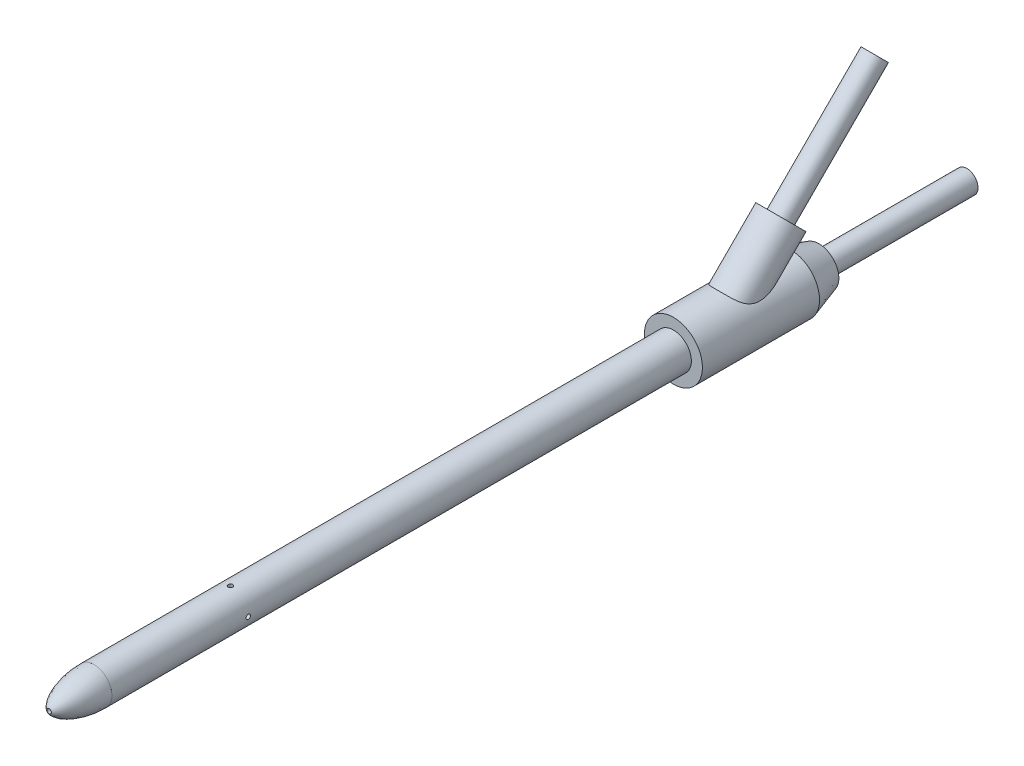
ISO-10303-21;
HEADER;
FILE_DESCRIPTION(('STEP AP214'),'2;1');
FILE_NAME('part.step','',(''),(''),'','','');
FILE_SCHEMA(('AUTOMOTIVE_DESIGN { 1 0 10303 214 1 1 1 1 }'));
ENDSEC;
DATA;
#1=APPLICATION_CONTEXT('core data for automotive mechanical design processes');
#2=APPLICATION_PROTOCOL_DEFINITION('international standard','automotive_design',2000,#1);
#3=PRODUCT_CONTEXT('',#1,'mechanical');
#4=PRODUCT('Part','Part','',(#3));
#5=PRODUCT_RELATED_PRODUCT_CATEGORY('part','',(#4));
#6=PRODUCT_DEFINITION_FORMATION('','',#4);
#7=PRODUCT_DEFINITION_CONTEXT('part definition',#1,'design');
#8=PRODUCT_DEFINITION('design','',#6,#7);
#9=PRODUCT_DEFINITION_SHAPE('','',#8);
#10=(LENGTH_UNIT() NAMED_UNIT(*) SI_UNIT(.MILLI.,.METRE.));
#11=(NAMED_UNIT(*) PLANE_ANGLE_UNIT() SI_UNIT($,.RADIAN.));
#12=(NAMED_UNIT(*) SI_UNIT($,.STERADIAN.) SOLID_ANGLE_UNIT());
#13=UNCERTAINTY_MEASURE_WITH_UNIT(LENGTH_MEASURE(1.E-05),#10,'distance_accuracy_value','');
#14=(GEOMETRIC_REPRESENTATION_CONTEXT(3) GLOBAL_UNCERTAINTY_ASSIGNED_CONTEXT((#13)) GLOBAL_UNIT_ASSIGNED_CONTEXT((#10,
#11,#12)) REPRESENTATION_CONTEXT('',''));
#15=CARTESIAN_POINT('',(0.,0.,0.));
#16=DIRECTION('',(0.,0.,1.));
#17=DIRECTION('',(1.,0.,0.));
#18=AXIS2_PLACEMENT_3D('',#15,#16,#17);
#19=CARTESIAN_POINT('',(0.,2.0066,64.7065));
#20=CARTESIAN_POINT('',(0.,2.04575996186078,67.4438721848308));
#21=CARTESIAN_POINT('',(0.,0.90587913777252,69.7345725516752));
#22=CARTESIAN_POINT('',(0.,0.,69.7865));
#23=B_SPLINE_CURVE_WITH_KNOTS('',3,(#19,#20,#21,#22),.UNSPECIFIED.,.F.,.F.,(4,4),(0.,
0.47082167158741),.UNSPECIFIED.);
#24=CARTESIAN_POINT('',(0.,0.,64.7065));
#25=DIRECTION('',(0.,0.,-1.));
#26=AXIS1_PLACEMENT('',#24,#25);
#27=SURFACE_OF_REVOLUTION('',#23,#26);
#28=CARTESIAN_POINT('',(0.,0.,64.7065));
#29=DIRECTION('',(0.,0.,-1.));
#30=DIRECTION('',(0.,1.,0.));
#31=AXIS2_PLACEMENT_3D('',#28,#29,#30);
#32=CIRCLE('',#31,2.0066);
#33=CARTESIAN_POINT('',(0.,2.0066,64.7065));
#34=VERTEX_POINT('',#33);
#35=EDGE_CURVE('E11',#34,#34,#32,.T.);
#36=ORIENTED_EDGE('',*,*,#35,.F.);
#37=EDGE_LOOP('',(#36));
#38=FACE_BOUND('',#37,.T.);
#39=CARTESIAN_POINT('',(0.,0.,69.7171298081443));
#40=DIRECTION('',(0.,0.,-1.));
#41=DIRECTION('',(0.,1.,0.));
#42=AXIS2_PLACEMENT_3D('',#39,#40,#41);
#43=CIRCLE('',#42,0.254000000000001);
#44=CARTESIAN_POINT('',(0.,0.254,69.7171298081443));
#45=VERTEX_POINT('',#44);
#46=EDGE_CURVE('E53',#45,#45,#43,.T.);
#47=ORIENTED_EDGE('',*,*,#46,.T.);
#48=EDGE_LOOP('',(#47));
#49=FACE_BOUND('',#48,.T.);
#50=ADVANCED_FACE('F49',(#38,#49),#27,.F.);
#51=CARTESIAN_POINT('',(0.,0.,64.7065));
#52=DIRECTION('',(0.,0.,-1.));
#53=DIRECTION('',(0.,1.,0.));
#54=AXIS2_PLACEMENT_3D('',#51,#52,#53);
#55=PLANE('',#54);
#56=ORIENTED_EDGE('',*,*,#35,.T.);
#57=EDGE_LOOP('',(#56));
#58=FACE_BOUND('',#57,.T.);
#59=CARTESIAN_POINT('',(0.,0.,64.7065));
#60=DIRECTION('',(0.,0.,-1.));
#61=DIRECTION('',(0.,1.,0.));
#62=AXIS2_PLACEMENT_3D('',#59,#60,#61);
#63=CIRCLE('',#62,0.254);
#64=CARTESIAN_POINT('',(0.,0.254,64.7065));
#65=VERTEX_POINT('',#64);
#66=EDGE_CURVE('E57',#65,#65,#63,.F.);
#67=ORIENTED_EDGE('',*,*,#66,.T.);
#68=EDGE_LOOP('',(#67));
#69=FACE_BOUND('',#68,.T.);
#70=ADVANCED_FACE('F51',(#58,#69),#55,.T.);
#71=CARTESIAN_POINT('',(0.,0.,69.7865));
#72=DIRECTION('',(0.,0.,-1.));
#73=DIRECTION('',(-1.,0.,0.));
#74=AXIS2_PLACEMENT_3D('',#71,#72,#73);
#75=CYLINDRICAL_SURFACE('',#74,0.254);
#76=ORIENTED_EDGE('',*,*,#66,.F.);
#77=EDGE_LOOP('',(#76));
#78=FACE_BOUND('',#77,.T.);
#79=ORIENTED_EDGE('',*,*,#46,.F.);
#80=EDGE_LOOP('',(#79));
#81=FACE_BOUND('',#80,.T.);
#82=ADVANCED_FACE('F72',(#78,#81),#75,.F.);
#83=CLOSED_SHELL('',(#50,#70,#82));
#84=MANIFOLD_SOLID_BREP('B2',#83);
#85=CARTESIAN_POINT('',(-3.2385,0.,49.4665));
#86=DIRECTION('',(1.,0.,0.));
#87=DIRECTION('',(0.,0.,-1.));
#88=AXIS2_PLACEMENT_3D('',#85,#86,#87);
#89=CYLINDRICAL_SURFACE('',#88,0.253999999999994);
#90=CARTESIAN_POINT('',(-0.99695,0.,49.2125));
#91=CARTESIAN_POINT('',(-0.996949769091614,0.0140248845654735,49.2125003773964));
#92=CARTESIAN_POINT('',(-0.996651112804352,0.0280539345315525,49.2136655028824));
#93=CARTESIAN_POINT('',(-0.995488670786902,0.0557093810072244,49.2182878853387));
#94=CARTESIAN_POINT('',(-0.994624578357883,0.0693355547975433,49.2217463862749));
#95=CARTESIAN_POINT('',(-0.992426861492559,0.0957819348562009,49.2308369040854));
#96=CARTESIAN_POINT('',(-0.991093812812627,0.108603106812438,49.2364662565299));
#97=CARTESIAN_POINT('',(-0.988099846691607,0.133119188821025,49.2497291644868));
#98=CARTESIAN_POINT('',(-0.986438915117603,0.144814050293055,49.2573628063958));
#99=CARTESIAN_POINT('',(-0.982929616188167,0.166994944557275,49.2745895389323));
#100=CARTESIAN_POINT('',(-0.981078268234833,0.177453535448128,49.284217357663));
#101=CARTESIAN_POINT('',(-0.977416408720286,0.196626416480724,49.3050848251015));
#102=CARTESIAN_POINT('',(-0.975605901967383,0.205340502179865,49.3163246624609));
#103=CARTESIAN_POINT('',(-0.972200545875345,0.220907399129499,49.3403118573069));
#104=CARTESIAN_POINT('',(-0.970609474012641,0.227729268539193,49.3530798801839));
#105=CARTESIAN_POINT('',(-0.967866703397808,0.23911901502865,49.3796286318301));
#106=CARTESIAN_POINT('',(-0.966714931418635,0.243687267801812,49.3934091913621));
#107=CARTESIAN_POINT('',(-0.965011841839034,0.250346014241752,49.4212894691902));
#108=CARTESIAN_POINT('',(-0.96444855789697,0.252485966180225,49.4353766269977));
#109=CARTESIAN_POINT('',(-0.963950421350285,0.254381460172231,49.4637203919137));
#110=CARTESIAN_POINT('',(-0.964015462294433,0.254137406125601,49.4779769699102));
#111=CARTESIAN_POINT('',(-0.964755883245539,0.251311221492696,49.5058738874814));
#112=CARTESIAN_POINT('',(-0.965415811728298,0.248788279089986,49.5195206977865));
#113=CARTESIAN_POINT('',(-0.967246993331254,0.241570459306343,49.5461906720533));
#114=CARTESIAN_POINT('',(-0.9684182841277,0.236875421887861,49.5592137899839));
#115=CARTESIAN_POINT('',(-0.971154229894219,0.225396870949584,49.5844241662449));
#116=CARTESIAN_POINT('',(-0.972722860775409,0.218592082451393,49.5966012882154));
#117=CARTESIAN_POINT('',(-0.976074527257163,0.203102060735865,49.6196619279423));
#118=CARTESIAN_POINT('',(-0.977857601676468,0.19441648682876,49.6305452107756));
#119=CARTESIAN_POINT('',(-0.981502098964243,0.1751059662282,49.6510481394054));
#120=CARTESIAN_POINT('',(-0.983364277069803,0.164431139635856,49.6606207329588));
#121=CARTESIAN_POINT('',(-0.986909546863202,0.141605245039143,49.6778490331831));
#122=CARTESIAN_POINT('',(-0.988592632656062,0.129454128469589,49.685504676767));
#123=CARTESIAN_POINT('',(-0.991598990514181,0.103951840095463,49.6986999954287));
#124=CARTESIAN_POINT('',(-0.992920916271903,0.0905964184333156,49.7042317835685));
#125=CARTESIAN_POINT('',(-0.995046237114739,0.0631039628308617,49.7129584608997));
#126=CARTESIAN_POINT('',(-0.995849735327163,0.048967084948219,49.7161538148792));
#127=CARTESIAN_POINT('',(-0.996832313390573,0.0207150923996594,49.7200444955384));
#128=CARTESIAN_POINT('',(-0.997027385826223,0.00660934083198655,49.720803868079));
#129=CARTESIAN_POINT('',(-0.996816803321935,-0.0215277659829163,49.7199770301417));
#130=CARTESIAN_POINT('',(-0.996411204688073,-0.0355591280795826,49.7183910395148));
#131=CARTESIAN_POINT('',(-0.995055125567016,-0.0629249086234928,49.7129712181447));
#132=CARTESIAN_POINT('',(-0.994113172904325,-0.076266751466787,49.7091725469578));
#133=CARTESIAN_POINT('',(-0.991790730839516,-0.102122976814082,49.699475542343));
#134=CARTESIAN_POINT('',(-0.990410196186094,-0.114637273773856,49.6935769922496));
#135=CARTESIAN_POINT('',(-0.987325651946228,-0.138736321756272,49.6797250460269));
#136=CARTESIAN_POINT('',(-0.985616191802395,-0.150299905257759,49.6717360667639));
#137=CARTESIAN_POINT('',(-0.982071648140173,-0.171944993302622,49.6539753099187));
#138=CARTESIAN_POINT('',(-0.98023654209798,-0.182026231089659,49.6442032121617));
#139=CARTESIAN_POINT('',(-0.976589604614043,-0.20068607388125,49.6228557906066));
#140=CARTESIAN_POINT('',(-0.974779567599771,-0.209219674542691,49.6112407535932));
#141=CARTESIAN_POINT('',(-0.971439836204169,-0.224216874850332,49.5867059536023));
#142=CARTESIAN_POINT('',(-0.969910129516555,-0.230680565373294,49.5737862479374));
#143=CARTESIAN_POINT('',(-0.967321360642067,-0.241306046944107,49.5470771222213));
#144=CARTESIAN_POINT('',(-0.966259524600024,-0.245481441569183,49.533293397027));
#145=CARTESIAN_POINT('',(-0.964724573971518,-0.25144674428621,49.5051882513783));
#146=CARTESIAN_POINT('',(-0.964251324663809,-0.253237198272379,49.4908669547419));
#147=CARTESIAN_POINT('',(-0.963957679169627,-0.254352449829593,49.4625519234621));
#148=CARTESIAN_POINT('',(-0.964118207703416,-0.253749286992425,49.4485611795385));
#149=CARTESIAN_POINT('',(-0.965029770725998,-0.250259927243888,49.4208879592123));
#150=CARTESIAN_POINT('',(-0.965780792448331,-0.247373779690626,49.4072054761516));
#151=CARTESIAN_POINT('',(-0.967777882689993,-0.23944041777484,49.3806189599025));
#152=CARTESIAN_POINT('',(-0.969020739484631,-0.234407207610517,49.3677104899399));
#153=CARTESIAN_POINT('',(-0.971861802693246,-0.222333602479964,49.3429118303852));
#154=CARTESIAN_POINT('',(-0.973460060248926,-0.215292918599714,49.3310217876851));
#155=CARTESIAN_POINT('',(-0.97688581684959,-0.199180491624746,49.3082505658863));
#156=CARTESIAN_POINT('',(-0.978718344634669,-0.190058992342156,49.2974053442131));
#157=CARTESIAN_POINT('',(-0.982376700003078,-0.170140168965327,49.2773760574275));
#158=CARTESIAN_POINT('',(-0.984202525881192,-0.159342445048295,49.2681923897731));
#159=CARTESIAN_POINT('',(-0.987683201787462,-0.13612993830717,49.2515762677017));
#160=CARTESIAN_POINT('',(-0.989334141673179,-0.123688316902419,49.2441804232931));
#161=CARTESIAN_POINT('',(-0.99223737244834,-0.0976971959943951,49.2315970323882));
#162=CARTESIAN_POINT('',(-0.99348994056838,-0.084148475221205,49.2264079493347));
#163=CARTESIAN_POINT('',(-0.995276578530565,-0.0588591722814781,49.219129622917));
#164=CARTESIAN_POINT('',(-0.995899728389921,-0.0472359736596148,49.2166489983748));
#165=CARTESIAN_POINT('',(-0.996736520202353,-0.0237428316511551,49.2133340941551));
#166=CARTESIAN_POINT('',(-0.996950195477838,-0.0118729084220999,49.2124996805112));
#167=CARTESIAN_POINT('',(-0.99695,0.,49.2125));
#168=B_SPLINE_CURVE_WITH_KNOTS('',3,(#90,#91,#92,#93,#94,#95,#96,#97,#98,#99,#100,#101,#102,
#103,#104,#105,#106,#107,#108,#109,#110,#111,#112,#113,#114,#115,#116,#117,#118,#119,#120,#121,
#122,#123,#124,#125,#126,#127,#128,#129,#130,#131,#132,#133,#134,#135,#136,#137,#138,#139,#140,
#141,#142,#143,#144,#145,#146,#147,#148,#149,#150,#151,#152,#153,#154,#155,#156,#157,#158,#159,
#160,#161,#162,#163,#164,#165,#166,#167),.UNSPECIFIED.,.T.,.F.,(4,2,2,2,2,2,2,2,2,2,2,2,2,2,2,2,
2,2,2,2,2,2,2,2,2,2,2,2,2,2,2,2,2,2,2,2,2,2,4),(0.,0.0420311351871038,0.0840850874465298,
0.12608758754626,0.168091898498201,0.210900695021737,0.253714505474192,0.297191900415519,
0.340662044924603,0.383229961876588,0.425790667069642,0.467276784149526,0.508765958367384,
0.550687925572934,0.592617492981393,0.635790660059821,0.678965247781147,0.722298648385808,
0.765623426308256,0.807799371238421,0.849971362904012,0.891490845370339,0.933014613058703,
0.975297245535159,1.01758747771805,1.06095887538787,1.10432836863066,1.14743715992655,
1.1905360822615,1.23234786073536,1.27415873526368,1.31570097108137,1.35724918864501,
1.39992047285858,1.44260195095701,1.48609481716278,1.52955734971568,1.56514212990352,
1.60072401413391),.UNSPECIFIED.);
#169=CARTESIAN_POINT('',(-0.99695,0.,49.2125));
#170=VERTEX_POINT('',#169);
#171=EDGE_CURVE('E149',#170,#170,#168,.T.);
#172=ORIENTED_EDGE('',*,*,#171,.T.);
#173=EDGE_LOOP('',(#172));
#174=FACE_BOUND('',#173,.T.);
#175=CARTESIAN_POINT('',(-2.0066,0.,49.7205));
#176=CARTESIAN_POINT('',(-2.00659979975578,-0.0142063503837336,49.7204993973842));
#177=CARTESIAN_POINT('',(-2.00644753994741,-0.0284215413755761,49.7193041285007));
#178=CARTESIAN_POINT('',(-2.00585479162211,-0.0564562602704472,49.7145548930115));
#179=CARTESIAN_POINT('',(-2.0054140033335,-0.0702753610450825,49.7109984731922));
#180=CARTESIAN_POINT('',(-2.00429384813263,-0.0971079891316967,49.7016334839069));
#181=CARTESIAN_POINT('',(-2.003614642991,-0.110122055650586,49.6958264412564));
#182=CARTESIAN_POINT('',(-2.00209316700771,-0.134988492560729,49.6821284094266));
#183=CARTESIAN_POINT('',(-2.00125092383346,-0.14684105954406,49.6742377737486));
#184=CARTESIAN_POINT('',(-1.99949207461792,-0.169117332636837,49.6565489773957));
#185=CARTESIAN_POINT('',(-1.99857511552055,-0.179533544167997,49.6467414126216));
#186=CARTESIAN_POINT('',(-1.99677302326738,-0.198576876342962,49.6255173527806));
#187=CARTESIAN_POINT('',(-1.99588789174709,-0.207203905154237,49.614100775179));
#188=CARTESIAN_POINT('',(-1.99424619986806,-0.22245197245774,49.5899339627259));
#189=CARTESIAN_POINT('',(-1.99349009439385,-0.229065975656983,49.5771792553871));
#190=CARTESIAN_POINT('',(-1.99219672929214,-0.240055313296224,49.5507289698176));
#191=CARTESIAN_POINT('',(-1.99165946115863,-0.244430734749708,49.5370334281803));
#192=CARTESIAN_POINT('',(-1.99086797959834,-0.250795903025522,49.5091680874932));
#193=CARTESIAN_POINT('',(-1.99061226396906,-0.252798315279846,49.4950012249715));
#194=CARTESIAN_POINT('',(-1.99040824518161,-0.254399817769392,49.4665304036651));
#195=CARTESIAN_POINT('',(-1.99045992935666,-0.253999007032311,49.4522264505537));
#196=CARTESIAN_POINT('',(-1.99086349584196,-0.250815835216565,49.4239758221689));
#197=CARTESIAN_POINT('',(-1.99121361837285,-0.248047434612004,49.4100275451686));
#198=CARTESIAN_POINT('',(-1.99217186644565,-0.240229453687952,49.3827951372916));
#199=CARTESIAN_POINT('',(-1.99277999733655,-0.235179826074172,49.3695110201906));
#200=CARTESIAN_POINT('',(-1.99418773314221,-0.222927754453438,49.3439407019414));
#201=CARTESIAN_POINT('',(-1.99498787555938,-0.215719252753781,49.3316574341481));
#202=CARTESIAN_POINT('',(-1.99668906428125,-0.199358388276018,49.3084696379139));
#203=CARTESIAN_POINT('',(-1.99759011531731,-0.190205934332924,49.2975651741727));
#204=CARTESIAN_POINT('',(-1.99939941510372,-0.170139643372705,49.2773634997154));
#205=CARTESIAN_POINT('',(-2.00030766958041,-0.159213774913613,49.2680782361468));
#206=CARTESIAN_POINT('',(-2.00202306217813,-0.135952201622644,49.2514715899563));
#207=CARTESIAN_POINT('',(-2.00283020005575,-0.123616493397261,49.2441502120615));
#208=CARTESIAN_POINT('',(-2.00425293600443,-0.0978761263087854,49.23167912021));
#209=CARTESIAN_POINT('',(-2.00486846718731,-0.0844710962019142,49.2265301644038));
#210=CARTESIAN_POINT('',(-2.00583803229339,-0.0569771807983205,49.2185596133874));
#211=CARTESIAN_POINT('',(-2.00619207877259,-0.042888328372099,49.2157379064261));
#212=CARTESIAN_POINT('',(-2.00659714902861,-0.0145299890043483,49.2125174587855));
#213=CARTESIAN_POINT('',(-2.00665023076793,-0.000262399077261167,49.2121022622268));
#214=CARTESIAN_POINT('',(-2.00645294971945,0.0281389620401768,49.2136631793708));
#215=CARTESIAN_POINT('',(-2.00620259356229,0.0422727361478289,49.2156392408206));
#216=CARTESIAN_POINT('',(-2.00542784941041,0.0699566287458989,49.2219129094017));
#217=CARTESIAN_POINT('',(-2.00490438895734,0.0835085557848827,49.2262026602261));
#218=CARTESIAN_POINT('',(-2.00364203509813,0.109700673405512,49.2369737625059));
#219=CARTESIAN_POINT('',(-2.00290313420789,0.122340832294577,49.2434551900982));
#220=CARTESIAN_POINT('',(-2.00128713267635,0.146424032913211,49.2584654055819));
#221=CARTESIAN_POINT('',(-2.00040932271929,0.157860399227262,49.2670048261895));
#222=CARTESIAN_POINT('',(-1.99861589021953,0.179143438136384,49.2858735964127));
#223=CARTESIAN_POINT('',(-1.99770026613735,0.188990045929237,49.2962030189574));
#224=CARTESIAN_POINT('',(-1.99592804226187,0.206872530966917,49.3184311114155));
#225=CARTESIAN_POINT('',(-1.99507181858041,0.214897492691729,49.3303385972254));
#226=CARTESIAN_POINT('',(-1.9935215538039,0.228833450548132,49.3553420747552));
#227=CARTESIAN_POINT('',(-1.99282750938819,0.234744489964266,49.368438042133));
#228=CARTESIAN_POINT('',(-1.99168275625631,0.244267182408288,49.395411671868));
#229=CARTESIAN_POINT('',(-1.99123139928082,0.247884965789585,49.4092871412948));
#230=CARTESIAN_POINT('',(-1.99062127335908,0.252738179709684,49.4374547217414));
#231=CARTESIAN_POINT('',(-1.99046249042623,0.253973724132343,49.4517468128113));
#232=CARTESIAN_POINT('',(-1.99045590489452,0.254025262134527,49.4802333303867));
#233=CARTESIAN_POINT('',(-1.99060589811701,0.252858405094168,49.4944277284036));
#234=CARTESIAN_POINT('',(-1.99119522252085,0.248174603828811,49.5224169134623));
#235=CARTESIAN_POINT('',(-1.99163455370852,0.244657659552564,49.5362117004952));
#236=CARTESIAN_POINT('',(-1.99275236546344,0.235378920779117,49.5630076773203));
#237=CARTESIAN_POINT('',(-1.99343075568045,0.229617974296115,49.5760091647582));
#238=CARTESIAN_POINT('',(-1.99495039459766,0.216016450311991,49.6008636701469));
#239=CARTESIAN_POINT('',(-1.99579164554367,0.208175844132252,49.6127166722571));
#240=CARTESIAN_POINT('',(-1.99754941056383,0.190574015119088,49.6350253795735));
#241=CARTESIAN_POINT('',(-1.99846640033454,0.180800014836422,49.6454709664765));
#242=CARTESIAN_POINT('',(-2.0002681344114,0.159635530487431,49.6645802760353));
#243=CARTESIAN_POINT('',(-2.00115287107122,0.148244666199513,49.6732435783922));
#244=CARTESIAN_POINT('',(-2.00279423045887,0.124118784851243,49.6885712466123));
#245=CARTESIAN_POINT('',(-2.00355034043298,0.111378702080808,49.6952276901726));
#246=CARTESIAN_POINT('',(-2.004844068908,0.0849590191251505,49.7062971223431));
#247=CARTESIAN_POINT('',(-2.00538192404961,0.0712804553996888,49.7107125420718));
#248=CARTESIAN_POINT('',(-2.00604928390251,0.0479430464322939,49.7161208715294));
#249=CARTESIAN_POINT('',(-2.00625479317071,0.0384311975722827,49.7177606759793));
#250=CARTESIAN_POINT('',(-2.00653021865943,0.0192809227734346,49.7199504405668));
#251=CARTESIAN_POINT('',(-2.00660013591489,0.00964249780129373,49.7205004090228));
#252=CARTESIAN_POINT('',(-2.0066,0.,49.7205));
#253=B_SPLINE_CURVE_WITH_KNOTS('',3,(#175,#176,#177,#178,#179,#180,#181,#182,#183,#184,#185,
#186,#187,#188,#189,#190,#191,#192,#193,#194,#195,#196,#197,#198,#199,#200,#201,#202,#203,#204,
#205,#206,#207,#208,#209,#210,#211,#212,#213,#214,#215,#216,#217,#218,#219,#220,#221,#222,#223,
#224,#225,#226,#227,#228,#229,#230,#231,#232,#233,#234,#235,#236,#237,#238,#239,#240,#241,#242,
#243,#244,#245,#246,#247,#248,#249,#250,#251,#252),.UNSPECIFIED.,.T.,.F.,(4,2,2,2,2,2,2,2,2,2,2,
2,2,2,2,2,2,2,2,2,2,2,2,2,2,2,2,2,2,2,2,2,2,2,2,2,2,2,4),(0.,0.0425838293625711,
0.0852119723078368,0.127811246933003,0.170403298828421,0.213209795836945,0.256018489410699,
0.298975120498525,0.341930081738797,0.384654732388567,0.427377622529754,0.46985032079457,
0.512323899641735,0.554917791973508,0.597513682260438,0.640411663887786,0.683309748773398,
0.726222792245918,0.769133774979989,0.811750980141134,0.854367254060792,0.896839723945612,
0.939313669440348,0.982011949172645,1.02471196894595,1.06766146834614,1.11061008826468,
1.153443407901,1.1962746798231,1.23880126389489,1.28132784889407,1.32383837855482,
1.3663494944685,1.40915155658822,1.45196370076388,1.49494270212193,1.53787497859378,
1.56677878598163,1.59568237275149),.UNSPECIFIED.);
#254=CARTESIAN_POINT('',(-2.0066,0.,49.7205));
#255=VERTEX_POINT('',#254);
#256=EDGE_CURVE('E124',#255,#255,#253,.T.);
#257=ORIENTED_EDGE('',*,*,#256,.F.);
#258=EDGE_LOOP('',(#257));
#259=FACE_BOUND('',#258,.T.);
#260=ADVANCED_FACE('F108',(#174,#259),#89,.F.);
#261=CARTESIAN_POINT('',(0.,-2.00660000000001,49.4665));
#262=DIRECTION('',(0.,1.,0.));
#263=DIRECTION('',(-1.,0.,0.));
#264=AXIS2_PLACEMENT_3D('',#261,#262,#263);
#265=CYLINDRICAL_SURFACE('',#264,0.253999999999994);
#266=CARTESIAN_POINT('',(-0.253999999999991,-0.964050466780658,49.4665));
#267=CARTESIAN_POINT('',(-0.253999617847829,-0.964050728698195,49.4805165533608));
#268=CARTESIAN_POINT('',(-0.25283582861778,-0.964359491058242,49.4945372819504));
#269=CARTESIAN_POINT('',(-0.248219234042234,-0.96555787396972,49.5221754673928));
#270=CARTESIAN_POINT('',(-0.244765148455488,-0.966447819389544,49.535792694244));
#271=CARTESIAN_POINT('',(-0.235687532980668,-0.968701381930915,49.5622200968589));
#272=CARTESIAN_POINT('',(-0.230066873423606,-0.970064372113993,49.5750313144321));
#273=CARTESIAN_POINT('',(-0.216824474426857,-0.973109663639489,49.5995305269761));
#274=CARTESIAN_POINT('',(-0.209202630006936,-0.974791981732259,49.6112184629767));
#275=CARTESIAN_POINT('',(-0.19198815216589,-0.978329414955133,49.6334063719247));
#276=CARTESIAN_POINT('',(-0.182358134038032,-0.980187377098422,49.6438768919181));
#277=CARTESIAN_POINT('',(-0.161481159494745,-0.983842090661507,49.6630730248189));
#278=CARTESIAN_POINT('',(-0.150234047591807,-0.985638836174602,49.67179846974));
#279=CARTESIAN_POINT('',(-0.126239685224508,-0.989000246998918,49.6873779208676));
#280=CARTESIAN_POINT('',(-0.113473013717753,-0.99056116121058,49.694202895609));
#281=CARTESIAN_POINT('',(-0.0869271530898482,-0.993242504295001,49.7055987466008));
#282=CARTESIAN_POINT('',(-0.0731481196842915,-0.994363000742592,49.7101699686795));
#283=CARTESIAN_POINT('',(-0.0452758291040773,-0.996017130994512,49.7168339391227));
#284=CARTESIAN_POINT('',(-0.0311952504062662,-0.996562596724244,49.718976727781));
#285=CARTESIAN_POINT('',(-0.00286461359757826,-0.997046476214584,49.7208801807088));
#286=CARTESIAN_POINT('',(0.0113854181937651,-0.996984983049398,49.7206412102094));
#287=CARTESIAN_POINT('',(0.0393030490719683,-0.996270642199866,49.7178237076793));
#288=CARTESIAN_POINT('',(0.0529765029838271,-0.995631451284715,49.7152992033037));
#289=CARTESIAN_POINT('',(0.0796989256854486,-0.993849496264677,49.7080692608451));
#290=CARTESIAN_POINT('',(0.0927478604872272,-0.992706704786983,49.7033637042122));
#291=CARTESIAN_POINT('',(0.117991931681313,-0.99002524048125,49.6918621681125));
#292=CARTESIAN_POINT('',(0.130178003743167,-0.988482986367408,49.6850471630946));
#293=CARTESIAN_POINT('',(0.153252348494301,-0.985169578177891,49.6695346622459));
#294=CARTESIAN_POINT('',(0.164140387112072,-0.983398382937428,49.6608368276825));
#295=CARTESIAN_POINT('',(0.18463189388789,-0.979761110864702,49.641516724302));
#296=CARTESIAN_POINT('',(0.194190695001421,-0.977893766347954,49.6308472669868));
#297=CARTESIAN_POINT('',(0.211393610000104,-0.974319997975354,49.6080373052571));
#298=CARTESIAN_POINT('',(0.21903762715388,-0.972613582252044,49.5958967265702));
#299=CARTESIAN_POINT('',(0.232224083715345,-0.969550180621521,49.5703989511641));
#300=CARTESIAN_POINT('',(0.237755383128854,-0.968195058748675,49.5570357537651));
#301=CARTESIAN_POINT('',(0.246478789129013,-0.966011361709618,49.5295261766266));
#302=CARTESIAN_POINT('',(0.24967141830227,-0.965182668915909,49.5153799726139));
#303=CARTESIAN_POINT('',(0.253551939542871,-0.964170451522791,49.4871211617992));
#304=CARTESIAN_POINT('',(0.254306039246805,-0.963969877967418,49.473018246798));
#305=CARTESIAN_POINT('',(0.253469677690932,-0.964190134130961,49.444888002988));
#306=CARTESIAN_POINT('',(0.251879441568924,-0.964610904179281,49.4308606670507));
#307=CARTESIAN_POINT('',(0.2464576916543,-0.966010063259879,49.4035281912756));
#308=CARTESIAN_POINT('',(0.242665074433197,-0.966978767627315,49.3902147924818));
#309=CARTESIAN_POINT('',(0.232989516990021,-0.96935537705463,49.364412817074));
#310=CARTESIAN_POINT('',(0.227106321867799,-0.970763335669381,49.3519243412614));
#311=CARTESIAN_POINT('',(0.213279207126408,-0.973895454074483,49.3278471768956));
#312=CARTESIAN_POINT('',(0.2052959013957,-0.975625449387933,49.3162818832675));
#313=CARTESIAN_POINT('',(0.187544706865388,-0.979192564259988,49.29463077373));
#314=CARTESIAN_POINT('',(0.17777651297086,-0.981029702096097,49.2845452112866));
#315=CARTESIAN_POINT('',(0.15642830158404,-0.9846621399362,49.2658698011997));
#316=CARTESIAN_POINT('',(0.144807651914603,-0.986455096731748,49.2573258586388));
#317=CARTESIAN_POINT('',(0.120258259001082,-0.989747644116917,49.2423104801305));
#318=CARTESIAN_POINT('',(0.107329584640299,-0.991247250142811,49.2358389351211));
#319=CARTESIAN_POINT('',(0.0806212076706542,-0.993774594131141,49.2252092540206));
#320=CARTESIAN_POINT('',(0.0668485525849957,-0.994805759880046,49.2210342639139));
#321=CARTESIAN_POINT('',(0.038767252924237,-0.996295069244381,49.2150660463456));
#322=CARTESIAN_POINT('',(0.0244587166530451,-0.996753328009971,49.2132723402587));
#323=CARTESIAN_POINT('',(-0.00385760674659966,-0.997040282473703,49.2121453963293));
#324=CARTESIAN_POINT('',(-0.017862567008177,-0.99688628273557,49.2127445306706));
#325=CARTESIAN_POINT('',(-0.0455653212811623,-0.996004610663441,49.2162307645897));
#326=CARTESIAN_POINT('',(-0.0592631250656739,-0.995276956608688,49.2191177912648));
#327=CARTESIAN_POINT('',(-0.0858889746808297,-0.993332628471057,49.2270610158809));
#328=CARTESIAN_POINT('',(-0.0988210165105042,-0.99211880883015,49.2321045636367));
#329=CARTESIAN_POINT('',(-0.123662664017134,-0.989329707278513,49.2442062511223));
#330=CARTESIAN_POINT('',(-0.135572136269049,-0.987754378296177,49.2512646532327));
#331=CARTESIAN_POINT('',(-0.158349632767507,-0.984363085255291,49.2673996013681));
#332=CARTESIAN_POINT('',(-0.169184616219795,-0.982542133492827,49.2765217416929));
#333=CARTESIAN_POINT('',(-0.18919296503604,-0.97888661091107,49.2964372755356));
#334=CARTESIAN_POINT('',(-0.198365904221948,-0.977052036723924,49.3072310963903));
#335=CARTESIAN_POINT('',(-0.214966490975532,-0.97353597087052,49.3304378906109));
#336=CARTESIAN_POINT('',(-0.222356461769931,-0.971858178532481,49.3428784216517));
#337=CARTESIAN_POINT('',(-0.234929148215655,-0.968896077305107,49.3688663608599));
#338=CARTESIAN_POINT('',(-0.240113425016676,-0.967611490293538,49.3824129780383));
#339=CARTESIAN_POINT('',(-0.247381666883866,-0.965775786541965,49.4076906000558));
#340=CARTESIAN_POINT('',(-0.249858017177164,-0.965133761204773,49.4193037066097));
#341=CARTESIAN_POINT('',(-0.253167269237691,-0.96427101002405,49.4427768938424));
#342=CARTESIAN_POINT('',(-0.25400032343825,-0.964050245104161,49.4546369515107));
#343=CARTESIAN_POINT('',(-0.253999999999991,-0.964050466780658,49.4665));
#344=B_SPLINE_CURVE_WITH_KNOTS('',3,(#266,#267,#268,#269,#270,#271,#272,#273,#274,#275,#276,
#277,#278,#279,#280,#281,#282,#283,#284,#285,#286,#287,#288,#289,#290,#291,#292,#293,#294,#295,
#296,#297,#298,#299,#300,#301,#302,#303,#304,#305,#306,#307,#308,#309,#310,#311,#312,#313,#314,
#315,#316,#317,#318,#319,#320,#321,#322,#323,#324,#325,#326,#327,#328,#329,#330,#331,#332,#333,
#334,#335,#336,#337,#338,#339,#340,#341,#342,#343),.UNSPECIFIED.,.T.,.F.,(4,2,2,2,2,2,2,2,2,2,2,
2,2,2,2,2,2,2,2,2,2,2,2,2,2,2,2,2,2,2,2,2,2,2,2,2,2,2,4),(0.,0.0420060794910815,
0.0840356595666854,0.126009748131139,0.167986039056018,0.210827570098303,0.253673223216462,
0.297141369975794,0.340602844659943,0.383151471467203,0.425693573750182,0.467255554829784,
0.508819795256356,0.550770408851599,0.592728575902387,0.635865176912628,0.679003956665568,
0.722367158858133,0.765720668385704,0.807886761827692,0.850048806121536,0.891487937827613,
0.932932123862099,0.975217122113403,1.0175093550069,1.06090534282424,1.10429904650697,
1.14736989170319,1.19043207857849,1.23228595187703,1.27413849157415,1.31574882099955,
1.35736457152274,1.40000953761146,1.44266542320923,1.48615625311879,1.52961624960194,
1.5651718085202,1.6007240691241),.UNSPECIFIED.);
#345=CARTESIAN_POINT('',(-0.253999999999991,-0.964050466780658,49.4665));
#346=VERTEX_POINT('',#345);
#347=EDGE_CURVE('E159',#346,#346,#344,.T.);
#348=ORIENTED_EDGE('',*,*,#347,.T.);
#349=EDGE_LOOP('',(#348));
#350=FACE_BOUND('',#349,.T.);
#351=CARTESIAN_POINT('',(-0.253999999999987,-1.99045913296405,49.4665));
#352=CARTESIAN_POINT('',(-0.253999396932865,-1.99045933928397,49.4807058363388));
#353=CARTESIAN_POINT('',(-0.252804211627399,-1.99061285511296,49.4949205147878));
#354=CARTESIAN_POINT('',(-0.248055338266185,-1.99121008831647,49.5229541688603));
#355=CARTESIAN_POINT('',(-0.244499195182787,-1.99165410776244,49.5367727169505));
#356=CARTESIAN_POINT('',(-0.235135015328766,-1.99278126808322,49.5636041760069));
#357=CARTESIAN_POINT('',(-0.229328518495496,-1.99346424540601,49.576617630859));
#358=CARTESIAN_POINT('',(-0.215631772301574,-1.99499217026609,49.6014830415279));
#359=CARTESIAN_POINT('',(-0.207741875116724,-1.99583709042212,49.6133351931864));
#360=CARTESIAN_POINT('',(-0.190053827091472,-1.99759912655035,49.63561192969));
#361=CARTESIAN_POINT('',(-0.180246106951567,-1.99851659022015,49.6460288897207));
#362=CARTESIAN_POINT('',(-0.1590214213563,-2.00031721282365,49.6650736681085));
#363=CARTESIAN_POINT('',(-0.147604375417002,-2.00120037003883,49.673701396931));
#364=CARTESIAN_POINT('',(-0.123437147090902,-2.00283643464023,49.6889502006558));
#365=CARTESIAN_POINT('',(-0.110682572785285,-2.00358888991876,49.6955643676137));
#366=CARTESIAN_POINT('',(-0.0842325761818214,-2.00487494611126,49.7065540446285));
#367=CARTESIAN_POINT('',(-0.0705371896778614,-2.00540855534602,49.7109296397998));
#368=CARTESIAN_POINT('',(-0.0426723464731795,-2.00619434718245,49.7172951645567));
#369=CARTESIAN_POINT('',(-0.0285058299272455,-2.00644802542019,49.7192977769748));
#370=CARTESIAN_POINT('',(-3.56877019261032E-05,-2.00665048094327,49.7208997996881));
#371=CARTESIAN_POINT('',(0.0142679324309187,-2.00659927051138,49.7204993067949));
#372=CARTESIAN_POINT('',(0.0425199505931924,-2.00619892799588,49.717316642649));
#373=CARTESIAN_POINT('',(0.0564699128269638,-2.00585150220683,49.7145481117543));
#374=CARTESIAN_POINT('',(0.0837056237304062,-2.00489968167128,49.7067292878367));
#375=CARTESIAN_POINT('',(0.0969913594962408,-2.00429528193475,49.7016789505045));
#376=CARTESIAN_POINT('',(0.122563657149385,-2.00289448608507,49.6894254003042));
#377=CARTESIAN_POINT('',(0.134847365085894,-2.00209756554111,49.682216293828));
#378=CARTESIAN_POINT('',(0.158035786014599,-2.00040086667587,49.6658541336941));
#379=CARTESIAN_POINT('',(0.168940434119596,-1.99950108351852,49.6567009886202));
#380=CARTESIAN_POINT('',(0.189141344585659,-1.99769189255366,49.6366342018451));
#381=CARTESIAN_POINT('',(0.198425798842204,-1.99678246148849,49.6257086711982));
#382=CARTESIAN_POINT('',(0.215030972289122,-1.99506269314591,49.6024480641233));
#383=CARTESIAN_POINT('',(0.222351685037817,-1.99425235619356,49.5901129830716));
#384=CARTESIAN_POINT('',(0.234822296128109,-1.99282253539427,49.5643727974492));
#385=CARTESIAN_POINT('',(0.239971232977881,-1.99220313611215,49.5509672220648));
#386=CARTESIAN_POINT('',(0.24794157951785,-1.99122695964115,49.5234721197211));
#387=CARTESIAN_POINT('',(0.250763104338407,-1.99087016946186,49.5093826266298));
#388=CARTESIAN_POINT('',(0.253982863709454,-1.99046198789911,49.4810239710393));
#389=CARTESIAN_POINT('',(0.254397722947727,-1.99040850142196,49.4667567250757));
#390=CARTESIAN_POINT('',(0.25283625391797,-1.99060744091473,49.4383561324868));
#391=CARTESIAN_POINT('',(0.250859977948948,-1.99085986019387,49.4242227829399));
#392=CARTESIAN_POINT('',(0.244586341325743,-1.99164025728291,49.3965410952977));
#393=CARTESIAN_POINT('',(0.24029704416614,-1.99216727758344,49.3829909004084));
#394=CARTESIAN_POINT('',(0.229527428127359,-1.99343671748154,49.3568020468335));
#395=CARTESIAN_POINT('',(0.223047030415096,-1.99417914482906,49.3441634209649));
#396=CARTESIAN_POINT('',(0.208038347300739,-1.99580075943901,49.3200812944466));
#397=CARTESIAN_POINT('',(0.199499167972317,-1.99668066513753,49.3086446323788));
#398=CARTESIAN_POINT('',(0.180630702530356,-1.99847584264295,49.2873608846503));
#399=CARTESIAN_POINT('',(0.170301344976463,-1.99939111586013,49.2775138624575));
#400=CARTESIAN_POINT('',(0.148073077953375,-2.00116034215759,49.2596304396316));
#401=CARTESIAN_POINT('',(0.136165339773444,-2.00201390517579,49.2516049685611));
#402=CARTESIAN_POINT('',(0.111161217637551,-2.0035576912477,49.2376681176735));
#403=CARTESIAN_POINT('',(0.098064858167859,-2.00424791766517,49.2317566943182));
#404=CARTESIAN_POINT('',(0.0710914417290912,-2.0053855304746,49.2222337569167));
#405=CARTESIAN_POINT('',(0.0572166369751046,-2.00583358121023,49.2186159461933));
#406=CARTESIAN_POINT('',(0.0290504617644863,-2.00643911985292,49.2137624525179));
#407=CARTESIAN_POINT('',(0.0147591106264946,-2.00659662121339,49.2125266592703));
#408=CARTESIAN_POINT('',(-0.0137278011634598,-2.00660324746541,49.2124743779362));
#409=CARTESIAN_POINT('',(-0.0279233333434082,-2.0064545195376,49.213641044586));
#410=CARTESIAN_POINT('',(-0.055914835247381,-2.00586966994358,49.2183248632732));
#411=CARTESIAN_POINT('',(-0.0697108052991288,-2.00543354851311,49.2218420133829));
#412=CARTESIAN_POINT('',(-0.0965092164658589,-2.00432269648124,49.2311216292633));
#413=CARTESIAN_POINT('',(-0.109511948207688,-2.00364805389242,49.2368832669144));
#414=CARTESIAN_POINT('',(-0.134368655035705,-2.00213482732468,49.2504865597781));
#415=CARTESIAN_POINT('',(-0.146222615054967,-2.00129624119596,49.258328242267));
#416=CARTESIAN_POINT('',(-0.168531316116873,-1.99954169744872,49.2759312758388));
#417=CARTESIAN_POINT('',(-0.17897613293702,-1.99862525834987,49.28570515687));
#418=CARTESIAN_POINT('',(-0.198083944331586,-1.99682214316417,49.3068690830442));
#419=CARTESIAN_POINT('',(-0.206746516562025,-1.99593547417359,49.3182595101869));
#420=CARTESIAN_POINT('',(-0.222073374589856,-1.99428854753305,49.3423850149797));
#421=CARTESIAN_POINT('',(-0.228729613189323,-1.99352880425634,49.3551252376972));
#422=CARTESIAN_POINT('',(-0.239798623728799,-1.9922277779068,49.3815452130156));
#423=CARTESIAN_POINT('',(-0.244213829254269,-1.99168625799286,49.3952239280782));
#424=CARTESIAN_POINT('',(-0.249621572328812,-1.99101410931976,49.4185607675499));
#425=CARTESIAN_POINT('',(-0.251261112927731,-1.99080703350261,49.4280718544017));
#426=CARTESIAN_POINT('',(-0.253450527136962,-1.99052947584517,49.4472206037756));
#427=CARTESIAN_POINT('',(-0.254000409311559,-1.99045899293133,49.4568582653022));
#428=CARTESIAN_POINT('',(-0.253999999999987,-1.99045913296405,49.4665));
#429=B_SPLINE_CURVE_WITH_KNOTS('',3,(#351,#352,#353,#354,#355,#356,#357,#358,#359,#360,#361,
#362,#363,#364,#365,#366,#367,#368,#369,#370,#371,#372,#373,#374,#375,#376,#377,#378,#379,#380,
#381,#382,#383,#384,#385,#386,#387,#388,#389,#390,#391,#392,#393,#394,#395,#396,#397,#398,#399,
#400,#401,#402,#403,#404,#405,#406,#407,#408,#409,#410,#411,#412,#413,#414,#415,#416,#417,#418,
#419,#420,#421,#422,#423,#424,#425,#426,#427,#428),.UNSPECIFIED.,.T.,.F.,(4,2,2,2,2,2,2,2,2,2,2,
2,2,2,2,2,2,2,2,2,2,2,2,2,2,2,2,2,2,2,2,2,2,2,2,2,2,2,4),(0.,0.0425822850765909,
0.0852089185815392,0.127806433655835,0.170396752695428,0.213205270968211,0.256015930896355,
0.298971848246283,0.341926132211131,0.384649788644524,0.427371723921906,0.46984921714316,
0.512327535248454,0.55492289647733,0.597520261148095,0.640416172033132,0.683312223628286,
0.726227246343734,0.769140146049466,0.81175625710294,0.854371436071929,0.896839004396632,
0.939308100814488,0.982007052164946,1.0247077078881,1.06765817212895,1.11060775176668,
1.15343890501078,1.19626807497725,1.23879796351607,1.2813278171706,1.32384199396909,
1.36635672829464,1.40915678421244,1.45196697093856,1.49494664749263,1.53787955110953,
1.56678107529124,1.59568237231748),.UNSPECIFIED.);
#430=CARTESIAN_POINT('',(-0.253999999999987,-1.99045913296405,49.4665));
#431=VERTEX_POINT('',#430);
#432=EDGE_CURVE('E127',#431,#431,#429,.T.);
#433=ORIENTED_EDGE('',*,*,#432,.F.);
#434=EDGE_LOOP('',(#433));
#435=FACE_BOUND('',#434,.T.);
#436=ADVANCED_FACE('F142',(#350,#435),#265,.F.);
#437=CARTESIAN_POINT('',(-0.253999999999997,0.964050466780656,49.4665));
#438=CARTESIAN_POINT('',(-0.253999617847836,0.964050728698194,49.4524834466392));
#439=CARTESIAN_POINT('',(-0.252835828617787,0.964359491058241,49.4384627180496));
#440=CARTESIAN_POINT('',(-0.248219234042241,0.965557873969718,49.4108245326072));
#441=CARTESIAN_POINT('',(-0.244765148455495,0.966447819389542,49.397207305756));
#442=CARTESIAN_POINT('',(-0.235687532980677,0.968701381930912,49.3707799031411));
#443=CARTESIAN_POINT('',(-0.230066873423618,0.97006437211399,49.3579686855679));
#444=CARTESIAN_POINT('',(-0.216824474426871,0.973109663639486,49.3334694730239));
#445=CARTESIAN_POINT('',(-0.209202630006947,0.974791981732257,49.3217815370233));
#446=CARTESIAN_POINT('',(-0.191988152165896,0.978329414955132,49.2995936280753));
#447=CARTESIAN_POINT('',(-0.182358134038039,0.980187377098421,49.2891231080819));
#448=CARTESIAN_POINT('',(-0.161481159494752,0.983842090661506,49.2699269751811));
#449=CARTESIAN_POINT('',(-0.150234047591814,0.985638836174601,49.26120153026));
#450=CARTESIAN_POINT('',(-0.126239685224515,0.989000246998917,49.2456220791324));
#451=CARTESIAN_POINT('',(-0.113473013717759,0.990561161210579,49.238797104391));
#452=CARTESIAN_POINT('',(-0.0869271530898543,0.993242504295,49.2274012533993));
#453=CARTESIAN_POINT('',(-0.0731481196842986,0.994363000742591,49.2228300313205));
#454=CARTESIAN_POINT('',(-0.0452758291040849,0.996017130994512,49.2161660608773));
#455=CARTESIAN_POINT('',(-0.0311952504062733,0.996562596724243,49.214023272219));
#456=CARTESIAN_POINT('',(-0.00286461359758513,0.997046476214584,49.2121198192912));
#457=CARTESIAN_POINT('',(0.0113854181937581,0.996984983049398,49.2123587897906));
#458=CARTESIAN_POINT('',(0.0393030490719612,0.996270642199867,49.2151762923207));
#459=CARTESIAN_POINT('',(0.0529765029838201,0.995631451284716,49.2177007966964));
#460=CARTESIAN_POINT('',(0.0796989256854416,0.993849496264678,49.2249307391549));
#461=CARTESIAN_POINT('',(0.0927478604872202,0.992706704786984,49.2296362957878));
#462=CARTESIAN_POINT('',(0.117991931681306,0.990025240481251,49.2411378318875));
#463=CARTESIAN_POINT('',(0.13017800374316,0.988482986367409,49.2479528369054));
#464=CARTESIAN_POINT('',(0.153252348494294,0.985169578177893,49.2634653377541));
#465=CARTESIAN_POINT('',(0.164140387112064,0.983398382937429,49.2721631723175));
#466=CARTESIAN_POINT('',(0.184631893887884,0.979761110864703,49.291483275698));
#467=CARTESIAN_POINT('',(0.194190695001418,0.977893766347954,49.3021527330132));
#468=CARTESIAN_POINT('',(0.2113936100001,0.974319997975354,49.3249626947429));
#469=CARTESIAN_POINT('',(0.219037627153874,0.972613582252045,49.3371032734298));
#470=CARTESIAN_POINT('',(0.232224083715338,0.969550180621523,49.3626010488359));
#471=CARTESIAN_POINT('',(0.237755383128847,0.968195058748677,49.3759642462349));
#472=CARTESIAN_POINT('',(0.246478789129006,0.96601136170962,49.4034738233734));
#473=CARTESIAN_POINT('',(0.249671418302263,0.965182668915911,49.4176200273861));
#474=CARTESIAN_POINT('',(0.253551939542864,0.964170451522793,49.4458788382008));
#475=CARTESIAN_POINT('',(0.254306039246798,0.96396987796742,49.459981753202));
#476=CARTESIAN_POINT('',(0.253469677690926,0.964190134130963,49.488111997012));
#477=CARTESIAN_POINT('',(0.251879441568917,0.964610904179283,49.5021393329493));
#478=CARTESIAN_POINT('',(0.246457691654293,0.966010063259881,49.5294718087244));
#479=CARTESIAN_POINT('',(0.24266507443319,0.966978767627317,49.5427852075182));
#480=CARTESIAN_POINT('',(0.232989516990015,0.969355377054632,49.568587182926));
#481=CARTESIAN_POINT('',(0.227106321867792,0.970763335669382,49.5810756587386));
#482=CARTESIAN_POINT('',(0.213279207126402,0.973895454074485,49.6051528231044));
#483=CARTESIAN_POINT('',(0.205295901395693,0.975625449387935,49.6167181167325));
#484=CARTESIAN_POINT('',(0.187544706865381,0.979192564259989,49.63836922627));
#485=CARTESIAN_POINT('',(0.177776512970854,0.981029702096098,49.6484547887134));
#486=CARTESIAN_POINT('',(0.156428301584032,0.984662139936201,49.6671301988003));
#487=CARTESIAN_POINT('',(0.144807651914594,0.98645509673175,49.6756741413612));
#488=CARTESIAN_POINT('',(0.120258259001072,0.989747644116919,49.6906895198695));
#489=CARTESIAN_POINT('',(0.107329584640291,0.991247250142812,49.6971610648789));
#490=CARTESIAN_POINT('',(0.0806212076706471,0.993774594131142,49.7077907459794));
#491=CARTESIAN_POINT('',(0.0668485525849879,0.994805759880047,49.7119657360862));
#492=CARTESIAN_POINT('',(0.0387672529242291,0.996295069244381,49.7179339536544));
#493=CARTESIAN_POINT('',(0.0244587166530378,0.996753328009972,49.7197276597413));
#494=CARTESIAN_POINT('',(-0.00385760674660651,0.997040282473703,49.7208546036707));
#495=CARTESIAN_POINT('',(-0.0178625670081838,0.99688628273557,49.7202554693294));
#496=CARTESIAN_POINT('',(-0.0455653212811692,0.996004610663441,49.7167692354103));
#497=CARTESIAN_POINT('',(-0.0592631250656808,0.995276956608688,49.7138822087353));
#498=CARTESIAN_POINT('',(-0.0858889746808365,0.993332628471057,49.7059389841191));
#499=CARTESIAN_POINT('',(-0.098821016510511,0.992118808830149,49.7008954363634));
#500=CARTESIAN_POINT('',(-0.123662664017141,0.989329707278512,49.6887937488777));
#501=CARTESIAN_POINT('',(-0.135572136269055,0.987754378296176,49.6817353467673));
#502=CARTESIAN_POINT('',(-0.158349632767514,0.98436308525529,49.665600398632));
#503=CARTESIAN_POINT('',(-0.169184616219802,0.982542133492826,49.6564782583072));
#504=CARTESIAN_POINT('',(-0.189192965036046,0.978886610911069,49.6365627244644));
#505=CARTESIAN_POINT('',(-0.198365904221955,0.977052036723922,49.6257689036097));
#506=CARTESIAN_POINT('',(-0.214966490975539,0.973535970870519,49.6025621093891));
#507=CARTESIAN_POINT('',(-0.222356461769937,0.97185817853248,49.5901215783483));
#508=CARTESIAN_POINT('',(-0.234929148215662,0.968896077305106,49.5641336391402));
#509=CARTESIAN_POINT('',(-0.240113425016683,0.967611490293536,49.5505870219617));
#510=CARTESIAN_POINT('',(-0.247381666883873,0.965775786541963,49.5253093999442));
#511=CARTESIAN_POINT('',(-0.249858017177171,0.965133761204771,49.5136962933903));
#512=CARTESIAN_POINT('',(-0.253167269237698,0.964271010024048,49.4902231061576));
#513=CARTESIAN_POINT('',(-0.254000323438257,0.96405024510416,49.4783630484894));
#514=CARTESIAN_POINT('',(-0.253999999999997,0.964050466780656,49.4665));
#515=B_SPLINE_CURVE_WITH_KNOTS('',3,(#437,#438,#439,#440,#441,#442,#443,#444,#445,#446,#447,
#448,#449,#450,#451,#452,#453,#454,#455,#456,#457,#458,#459,#460,#461,#462,#463,#464,#465,#466,
#467,#468,#469,#470,#471,#472,#473,#474,#475,#476,#477,#478,#479,#480,#481,#482,#483,#484,#485,
#486,#487,#488,#489,#490,#491,#492,#493,#494,#495,#496,#497,#498,#499,#500,#501,#502,#503,#504,
#505,#506,#507,#508,#509,#510,#511,#512,#513,#514),.UNSPECIFIED.,.T.,.F.,(4,2,2,2,2,2,2,2,2,2,2,
2,2,2,2,2,2,2,2,2,2,2,2,2,2,2,2,2,2,2,2,2,2,2,2,2,2,2,4),(0.,0.0420060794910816,
0.0840356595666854,0.126009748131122,0.167986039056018,0.210827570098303,0.253673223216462,
0.297141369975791,0.340602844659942,0.383151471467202,0.425693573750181,0.467255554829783,
0.508819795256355,0.550770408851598,0.592728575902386,0.63586517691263,0.679003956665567,
0.722367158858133,0.765720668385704,0.807886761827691,0.850048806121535,0.891487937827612,
0.932932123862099,0.975217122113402,1.0175093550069,1.06090534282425,1.10429904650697,
1.1473698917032,1.19043207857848,1.23228595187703,1.27413849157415,1.31574882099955,
1.35736457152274,1.40000953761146,1.44266542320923,1.48615625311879,1.52961624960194,
1.5651718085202,1.60072406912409),.UNSPECIFIED.);
#516=CARTESIAN_POINT('',(-0.253999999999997,0.964050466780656,49.4665));
#517=VERTEX_POINT('',#516);
#518=EDGE_CURVE('E183',#517,#517,#515,.T.);
#519=ORIENTED_EDGE('',*,*,#518,.T.);
#520=EDGE_LOOP('',(#519));
#521=FACE_BOUND('',#520,.T.);
#522=CARTESIAN_POINT('',(-0.254000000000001,1.99045913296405,49.4665));
#523=CARTESIAN_POINT('',(-0.253999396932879,1.99045933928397,49.4522941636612));
#524=CARTESIAN_POINT('',(-0.252804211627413,1.99061285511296,49.4380794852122));
#525=CARTESIAN_POINT('',(-0.248055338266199,1.99121008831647,49.4100458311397));
#526=CARTESIAN_POINT('',(-0.244499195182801,1.99165410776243,49.3962272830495));
#527=CARTESIAN_POINT('',(-0.235135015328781,1.99278126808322,49.3693958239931));
#528=CARTESIAN_POINT('',(-0.229328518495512,1.99346424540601,49.356382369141));
#529=CARTESIAN_POINT('',(-0.21563177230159,1.99499217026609,49.3315169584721));
#530=CARTESIAN_POINT('',(-0.207741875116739,1.99583709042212,49.3196648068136));
#531=CARTESIAN_POINT('',(-0.190053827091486,1.99759912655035,49.29738807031));
#532=CARTESIAN_POINT('',(-0.180246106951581,1.99851659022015,49.2869711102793));
#533=CARTESIAN_POINT('',(-0.159021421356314,2.00031721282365,49.2679263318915));
#534=CARTESIAN_POINT('',(-0.147604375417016,2.00120037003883,49.259298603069));
#535=CARTESIAN_POINT('',(-0.123437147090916,2.00283643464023,49.2440497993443));
#536=CARTESIAN_POINT('',(-0.110682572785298,2.00358888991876,49.2374356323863));
#537=CARTESIAN_POINT('',(-0.0842325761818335,2.00487494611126,49.2264459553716));
#538=CARTESIAN_POINT('',(-0.0705371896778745,2.00540855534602,49.2220703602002));
#539=CARTESIAN_POINT('',(-0.0426723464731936,2.00619434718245,49.2157048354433));
#540=CARTESIAN_POINT('',(-0.0285058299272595,2.00644802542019,49.2137022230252));
#541=CARTESIAN_POINT('',(-3.56877019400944E-05,2.00665048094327,49.2121002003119));
#542=CARTESIAN_POINT('',(0.0142679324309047,2.00659927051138,49.2125006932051));
#543=CARTESIAN_POINT('',(0.0425199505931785,2.00619892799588,49.215683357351));
#544=CARTESIAN_POINT('',(0.0564699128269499,2.00585150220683,49.2184518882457));
#545=CARTESIAN_POINT('',(0.0837056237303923,2.00489968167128,49.2262707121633));
#546=CARTESIAN_POINT('',(0.0969913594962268,2.00429528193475,49.2313210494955));
#547=CARTESIAN_POINT('',(0.122563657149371,2.00289448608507,49.2435745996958));
#548=CARTESIAN_POINT('',(0.134847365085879,2.00209756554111,49.250783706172));
#549=CARTESIAN_POINT('',(0.158035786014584,2.00040086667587,49.2671458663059));
#550=CARTESIAN_POINT('',(0.16894043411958,1.99950108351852,49.2762990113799));
#551=CARTESIAN_POINT('',(0.189141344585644,1.99769189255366,49.296365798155));
#552=CARTESIAN_POINT('',(0.198425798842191,1.99678246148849,49.3072913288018));
#553=CARTESIAN_POINT('',(0.215030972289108,1.99506269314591,49.3305519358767));
#554=CARTESIAN_POINT('',(0.222351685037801,1.99425235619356,49.3428870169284));
#555=CARTESIAN_POINT('',(0.234822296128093,1.99282253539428,49.3686272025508));
#556=CARTESIAN_POINT('',(0.239971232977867,1.99220313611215,49.3820327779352));
#557=CARTESIAN_POINT('',(0.247941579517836,1.99122695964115,49.4095278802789));
#558=CARTESIAN_POINT('',(0.250763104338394,1.99087016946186,49.4236173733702));
#559=CARTESIAN_POINT('',(0.253982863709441,1.99046198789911,49.4519760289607));
#560=CARTESIAN_POINT('',(0.254397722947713,1.99040850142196,49.4662432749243));
#561=CARTESIAN_POINT('',(0.252836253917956,1.99060744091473,49.4946438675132));
#562=CARTESIAN_POINT('',(0.250859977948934,1.99085986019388,49.5087772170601));
#563=CARTESIAN_POINT('',(0.244586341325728,1.99164025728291,49.5364589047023));
#564=CARTESIAN_POINT('',(0.240297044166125,1.99216727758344,49.5500090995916));
#565=CARTESIAN_POINT('',(0.229527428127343,1.99343671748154,49.5761979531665));
#566=CARTESIAN_POINT('',(0.223047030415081,1.99417914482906,49.5888365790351));
#567=CARTESIAN_POINT('',(0.208038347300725,1.99580075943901,49.6129187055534));
#568=CARTESIAN_POINT('',(0.199499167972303,1.99668066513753,49.6243553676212));
#569=CARTESIAN_POINT('',(0.180630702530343,1.99847584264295,49.6456391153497));
#570=CARTESIAN_POINT('',(0.17030134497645,1.99939111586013,49.6554861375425));
#571=CARTESIAN_POINT('',(0.148073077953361,2.00116034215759,49.6733695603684));
#572=CARTESIAN_POINT('',(0.136165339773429,2.00201390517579,49.6813950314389));
#573=CARTESIAN_POINT('',(0.111161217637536,2.0035576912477,49.6953318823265));
#574=CARTESIAN_POINT('',(0.0980648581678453,2.00424791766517,49.7012433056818));
#575=CARTESIAN_POINT('',(0.0710914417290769,2.0053855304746,49.7107662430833));
#576=CARTESIAN_POINT('',(0.0572166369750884,2.00583358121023,49.7143840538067));
#577=CARTESIAN_POINT('',(0.0290504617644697,2.00643911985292,49.7192375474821));
#578=CARTESIAN_POINT('',(0.0147591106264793,2.00659662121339,49.7204733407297));
#579=CARTESIAN_POINT('',(-0.0137278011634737,2.00660324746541,49.7205256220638));
#580=CARTESIAN_POINT('',(-0.0279233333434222,2.0064545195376,49.719358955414));
#581=CARTESIAN_POINT('',(-0.055914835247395,2.00586966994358,49.7146751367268));
#582=CARTESIAN_POINT('',(-0.0697108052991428,2.00543354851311,49.7111579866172));
#583=CARTESIAN_POINT('',(-0.0965092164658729,2.00432269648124,49.7018783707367));
#584=CARTESIAN_POINT('',(-0.109511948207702,2.00364805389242,49.6961167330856));
#585=CARTESIAN_POINT('',(-0.134368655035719,2.00213482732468,49.6825134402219));
#586=CARTESIAN_POINT('',(-0.146222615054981,2.00129624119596,49.674671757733));
#587=CARTESIAN_POINT('',(-0.168531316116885,1.99954169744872,49.6570687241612));
#588=CARTESIAN_POINT('',(-0.178976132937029,1.99862525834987,49.64729484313));
#589=CARTESIAN_POINT('',(-0.198083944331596,1.99682214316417,49.6261309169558));
#590=CARTESIAN_POINT('',(-0.206746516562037,1.99593547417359,49.6147404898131));
#591=CARTESIAN_POINT('',(-0.222073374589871,1.99428854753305,49.5906149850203));
#592=CARTESIAN_POINT('',(-0.228729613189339,1.99352880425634,49.5778747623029));
#593=CARTESIAN_POINT('',(-0.239798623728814,1.9922277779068,49.5514547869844));
#594=CARTESIAN_POINT('',(-0.244213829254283,1.99168625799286,49.5377760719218));
#595=CARTESIAN_POINT('',(-0.249621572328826,1.99101410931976,49.5144392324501));
#596=CARTESIAN_POINT('',(-0.251261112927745,1.9908070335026,49.5049281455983));
#597=CARTESIAN_POINT('',(-0.253450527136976,1.99052947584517,49.4857793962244));
#598=CARTESIAN_POINT('',(-0.254000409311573,1.99045899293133,49.4761417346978));
#599=CARTESIAN_POINT('',(-0.254000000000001,1.99045913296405,49.4665));
#600=B_SPLINE_CURVE_WITH_KNOTS('',3,(#522,#523,#524,#525,#526,#527,#528,#529,#530,#531,#532,
#533,#534,#535,#536,#537,#538,#539,#540,#541,#542,#543,#544,#545,#546,#547,#548,#549,#550,#551,
#552,#553,#554,#555,#556,#557,#558,#559,#560,#561,#562,#563,#564,#565,#566,#567,#568,#569,#570,
#571,#572,#573,#574,#575,#576,#577,#578,#579,#580,#581,#582,#583,#584,#585,#586,#587,#588,#589,
#590,#591,#592,#593,#594,#595,#596,#597,#598,#599),.UNSPECIFIED.,.T.,.F.,(4,2,2,2,2,2,2,2,2,2,2,
2,2,2,2,2,2,2,2,2,2,2,2,2,2,2,2,2,2,2,2,2,2,2,2,2,2,2,4),(0.,0.0425822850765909,
0.0852089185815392,0.127806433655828,0.170396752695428,0.213205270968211,0.256015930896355,
0.298971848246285,0.341926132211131,0.384649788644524,0.427371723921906,0.46984921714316,
0.512327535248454,0.554922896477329,0.597520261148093,0.640416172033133,0.683312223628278,
0.726227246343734,0.769140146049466,0.811756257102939,0.854371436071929,0.89683900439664,
0.939308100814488,0.982007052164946,1.0247077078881,1.06765817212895,1.11060775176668,
1.15343890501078,1.19626807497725,1.23879796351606,1.2813278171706,1.32384199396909,
1.36635672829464,1.40915678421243,1.45196697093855,1.49494664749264,1.53787955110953,
1.56678107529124,1.59568237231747),.UNSPECIFIED.);
#601=CARTESIAN_POINT('',(-0.254000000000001,1.99045913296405,49.4665));
#602=VERTEX_POINT('',#601);
#603=EDGE_CURVE('E286',#602,#602,#600,.T.);
#604=ORIENTED_EDGE('',*,*,#603,.F.);
#605=EDGE_LOOP('',(#604));
#606=FACE_BOUND('',#605,.T.);
#607=ADVANCED_FACE('F237',(#521,#606),#265,.F.);
#608=CARTESIAN_POINT('',(2.0066,0.,49.4665));
#609=DIRECTION('',(-1.,0.,0.));
#610=DIRECTION('',(0.,0.,1.));
#611=AXIS2_PLACEMENT_3D('',#608,#609,#610);
#612=CYLINDRICAL_SURFACE('',#611,0.253999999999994);
#613=CARTESIAN_POINT('',(0.99695,0.,49.7205));
#614=CARTESIAN_POINT('',(0.996949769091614,0.0140248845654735,49.7204996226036));
#615=CARTESIAN_POINT('',(0.996651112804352,0.0280539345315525,49.7193344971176));
#616=CARTESIAN_POINT('',(0.995488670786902,0.0557093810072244,49.7147121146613));
#617=CARTESIAN_POINT('',(0.994624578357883,0.0693355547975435,49.7112536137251));
#618=CARTESIAN_POINT('',(0.992426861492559,0.095781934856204,49.7021630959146));
#619=CARTESIAN_POINT('',(0.991093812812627,0.108603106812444,49.6965337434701));
#620=CARTESIAN_POINT('',(0.988099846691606,0.13311918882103,49.6832708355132));
#621=CARTESIAN_POINT('',(0.986438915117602,0.144814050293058,49.6756371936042));
#622=CARTESIAN_POINT('',(0.982929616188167,0.166994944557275,49.6584104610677));
#623=CARTESIAN_POINT('',(0.981078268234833,0.177453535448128,49.648782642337));
#624=CARTESIAN_POINT('',(0.977416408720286,0.196626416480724,49.6279151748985));
#625=CARTESIAN_POINT('',(0.975605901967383,0.205340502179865,49.6166753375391));
#626=CARTESIAN_POINT('',(0.972200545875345,0.2209073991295,49.5926881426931));
#627=CARTESIAN_POINT('',(0.97060947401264,0.227729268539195,49.5799201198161));
#628=CARTESIAN_POINT('',(0.967866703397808,0.239119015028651,49.5533713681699));
#629=CARTESIAN_POINT('',(0.966714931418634,0.243687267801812,49.5395908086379));
#630=CARTESIAN_POINT('',(0.965011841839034,0.250346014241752,49.5117105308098));
#631=CARTESIAN_POINT('',(0.96444855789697,0.252485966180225,49.4976233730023));
#632=CARTESIAN_POINT('',(0.963950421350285,0.254381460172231,49.4692796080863));
#633=CARTESIAN_POINT('',(0.964015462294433,0.254137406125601,49.4550230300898));
#634=CARTESIAN_POINT('',(0.964755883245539,0.251311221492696,49.4271261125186));
#635=CARTESIAN_POINT('',(0.965415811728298,0.248788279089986,49.4134793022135));
#636=CARTESIAN_POINT('',(0.967246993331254,0.241570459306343,49.3868093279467));
#637=CARTESIAN_POINT('',(0.9684182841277,0.236875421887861,49.3737862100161));
#638=CARTESIAN_POINT('',(0.971154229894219,0.225396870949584,49.3485758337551));
#639=CARTESIAN_POINT('',(0.972722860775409,0.218592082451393,49.3363987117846));
#640=CARTESIAN_POINT('',(0.976074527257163,0.203102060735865,49.3133380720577));
#641=CARTESIAN_POINT('',(0.977857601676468,0.19441648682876,49.3024547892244));
#642=CARTESIAN_POINT('',(0.981502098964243,0.1751059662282,49.2819518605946));
#643=CARTESIAN_POINT('',(0.983364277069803,0.164431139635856,49.2723792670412));
#644=CARTESIAN_POINT('',(0.986909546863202,0.141605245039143,49.2551509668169));
#645=CARTESIAN_POINT('',(0.988592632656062,0.129454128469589,49.247495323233));
#646=CARTESIAN_POINT('',(0.991598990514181,0.103951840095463,49.2343000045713));
#647=CARTESIAN_POINT('',(0.992920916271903,0.0905964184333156,49.2287682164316));
#648=CARTESIAN_POINT('',(0.995046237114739,0.0631039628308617,49.2200415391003));
#649=CARTESIAN_POINT('',(0.995849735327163,0.048967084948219,49.2168461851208));
#650=CARTESIAN_POINT('',(0.996832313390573,0.0207150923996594,49.2129555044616));
#651=CARTESIAN_POINT('',(0.997027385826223,0.00660934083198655,49.212196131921));
#652=CARTESIAN_POINT('',(0.996816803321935,-0.0215277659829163,49.2130229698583));
#653=CARTESIAN_POINT('',(0.996411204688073,-0.0355591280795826,49.2146089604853));
#654=CARTESIAN_POINT('',(0.995055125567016,-0.0629249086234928,49.2200287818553));
#655=CARTESIAN_POINT('',(0.994113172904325,-0.076266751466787,49.2238274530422));
#656=CARTESIAN_POINT('',(0.991790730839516,-0.102122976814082,49.233524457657));
#657=CARTESIAN_POINT('',(0.990410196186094,-0.114637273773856,49.2394230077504));
#658=CARTESIAN_POINT('',(0.987325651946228,-0.138736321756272,49.2532749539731));
#659=CARTESIAN_POINT('',(0.985616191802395,-0.150299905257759,49.2612639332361));
#660=CARTESIAN_POINT('',(0.982071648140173,-0.171944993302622,49.2790246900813));
#661=CARTESIAN_POINT('',(0.98023654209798,-0.18202623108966,49.2887967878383));
#662=CARTESIAN_POINT('',(0.976589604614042,-0.200686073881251,49.3101442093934));
#663=CARTESIAN_POINT('',(0.974779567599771,-0.209219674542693,49.3217592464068));
#664=CARTESIAN_POINT('',(0.971439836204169,-0.224216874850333,49.3462940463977));
#665=CARTESIAN_POINT('',(0.969910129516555,-0.230680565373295,49.3592137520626));
#666=CARTESIAN_POINT('',(0.967321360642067,-0.241306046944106,49.3859228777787));
#667=CARTESIAN_POINT('',(0.966259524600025,-0.245481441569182,49.399706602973));
#668=CARTESIAN_POINT('',(0.964724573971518,-0.25144674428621,49.4278117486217));
#669=CARTESIAN_POINT('',(0.964251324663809,-0.253237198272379,49.4421330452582));
#670=CARTESIAN_POINT('',(0.963957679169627,-0.254352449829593,49.4704480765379));
#671=CARTESIAN_POINT('',(0.964118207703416,-0.253749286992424,49.4844388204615));
#672=CARTESIAN_POINT('',(0.965029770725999,-0.250259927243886,49.5121120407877));
#673=CARTESIAN_POINT('',(0.965780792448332,-0.247373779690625,49.5257945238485));
#674=CARTESIAN_POINT('',(0.967777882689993,-0.23944041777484,49.5523810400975));
#675=CARTESIAN_POINT('',(0.969020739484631,-0.234407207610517,49.5652895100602));
#676=CARTESIAN_POINT('',(0.971861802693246,-0.222333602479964,49.5900881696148));
#677=CARTESIAN_POINT('',(0.973460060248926,-0.215292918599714,49.6019782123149));
#678=CARTESIAN_POINT('',(0.97688581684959,-0.199180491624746,49.6247494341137));
#679=CARTESIAN_POINT('',(0.978718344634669,-0.190058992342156,49.6355946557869));
#680=CARTESIAN_POINT('',(0.982376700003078,-0.170140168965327,49.6556239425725));
#681=CARTESIAN_POINT('',(0.984202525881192,-0.159342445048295,49.6648076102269));
#682=CARTESIAN_POINT('',(0.987683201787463,-0.136129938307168,49.6814237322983));
#683=CARTESIAN_POINT('',(0.989334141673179,-0.123688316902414,49.6888195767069));
#684=CARTESIAN_POINT('',(0.992237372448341,-0.0976971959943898,49.7014029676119));
#685=CARTESIAN_POINT('',(0.99348994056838,-0.084148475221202,49.7065920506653));
#686=CARTESIAN_POINT('',(0.995276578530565,-0.0588591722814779,49.713870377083));
#687=CARTESIAN_POINT('',(0.995899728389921,-0.0472359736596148,49.7163510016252));
#688=CARTESIAN_POINT('',(0.996736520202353,-0.0237428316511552,49.7196659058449));
#689=CARTESIAN_POINT('',(0.996950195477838,-0.0118729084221,49.7205003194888));
#690=CARTESIAN_POINT('',(0.99695,0.,49.7205));
#691=B_SPLINE_CURVE_WITH_KNOTS('',3,(#613,#614,#615,#616,#617,#618,#619,#620,#621,#622,#623,
#624,#625,#626,#627,#628,#629,#630,#631,#632,#633,#634,#635,#636,#637,#638,#639,#640,#641,#642,
#643,#644,#645,#646,#647,#648,#649,#650,#651,#652,#653,#654,#655,#656,#657,#658,#659,#660,#661,
#662,#663,#664,#665,#666,#667,#668,#669,#670,#671,#672,#673,#674,#675,#676,#677,#678,#679,#680,
#681,#682,#683,#684,#685,#686,#687,#688,#689,#690),.UNSPECIFIED.,.T.,.F.,(4,2,2,2,2,2,2,2,2,2,2,
2,2,2,2,2,2,2,2,2,2,2,2,2,2,2,2,2,2,2,2,2,2,2,2,2,2,2,4),(0.,0.0420311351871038,
0.0840850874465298,0.126087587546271,0.168091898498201,0.210900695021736,0.253714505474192,
0.297191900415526,0.340662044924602,0.383229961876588,0.425790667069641,0.467276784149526,
0.508765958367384,0.550687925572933,0.592617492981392,0.63579066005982,0.678965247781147,
0.722298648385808,0.765623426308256,0.807799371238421,0.849971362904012,0.891490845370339,
0.933014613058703,0.975297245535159,1.01758747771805,1.06095887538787,1.10432836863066,
1.14743715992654,1.1905360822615,1.23234786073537,1.27415873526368,1.31570097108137,
1.35724918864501,1.39992047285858,1.44260195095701,1.48609481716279,1.52955734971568,
1.56514212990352,1.60072401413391),.UNSPECIFIED.);
#692=CARTESIAN_POINT('',(0.99695,0.,49.7205));
#693=VERTEX_POINT('',#692);
#694=EDGE_CURVE('E177',#693,#693,#691,.T.);
#695=ORIENTED_EDGE('',*,*,#694,.T.);
#696=EDGE_LOOP('',(#695));
#697=FACE_BOUND('',#696,.T.);
#698=CARTESIAN_POINT('',(2.0066,0.,49.7205));
#699=CARTESIAN_POINT('',(2.00659979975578,0.0142063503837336,49.7204993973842));
#700=CARTESIAN_POINT('',(2.00644753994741,0.0284215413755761,49.7193041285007));
#701=CARTESIAN_POINT('',(2.00585479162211,0.0564562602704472,49.7145548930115));
#702=CARTESIAN_POINT('',(2.0054140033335,0.0702753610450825,49.7109984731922));
#703=CARTESIAN_POINT('',(2.00429384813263,0.0971079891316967,49.7016334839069));
#704=CARTESIAN_POINT('',(2.003614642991,0.110122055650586,49.6958264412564));
#705=CARTESIAN_POINT('',(2.00209316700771,0.134988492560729,49.6821284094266));
#706=CARTESIAN_POINT('',(2.00125092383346,0.14684105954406,49.6742377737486));
#707=CARTESIAN_POINT('',(1.99949207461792,0.169117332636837,49.6565489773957));
#708=CARTESIAN_POINT('',(1.99857511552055,0.179533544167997,49.6467414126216));
#709=CARTESIAN_POINT('',(1.99677302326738,0.198576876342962,49.6255173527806));
#710=CARTESIAN_POINT('',(1.99588789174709,0.207203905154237,49.614100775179));
#711=CARTESIAN_POINT('',(1.99424619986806,0.22245197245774,49.5899339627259));
#712=CARTESIAN_POINT('',(1.99349009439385,0.229065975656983,49.5771792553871));
#713=CARTESIAN_POINT('',(1.99219672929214,0.240055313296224,49.5507289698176));
#714=CARTESIAN_POINT('',(1.99165946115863,0.244430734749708,49.5370334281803));
#715=CARTESIAN_POINT('',(1.99086797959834,0.250795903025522,49.5091680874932));
#716=CARTESIAN_POINT('',(1.99061226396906,0.252798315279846,49.4950012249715));
#717=CARTESIAN_POINT('',(1.99040824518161,0.254399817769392,49.4665304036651));
#718=CARTESIAN_POINT('',(1.99045992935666,0.253999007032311,49.4522264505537));
#719=CARTESIAN_POINT('',(1.99086349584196,0.250815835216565,49.4239758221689));
#720=CARTESIAN_POINT('',(1.99121361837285,0.248047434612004,49.4100275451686));
#721=CARTESIAN_POINT('',(1.99217186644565,0.240229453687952,49.3827951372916));
#722=CARTESIAN_POINT('',(1.99277999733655,0.235179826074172,49.3695110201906));
#723=CARTESIAN_POINT('',(1.99418773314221,0.222927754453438,49.3439407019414));
#724=CARTESIAN_POINT('',(1.99498787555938,0.215719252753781,49.3316574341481));
#725=CARTESIAN_POINT('',(1.99668906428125,0.199358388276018,49.3084696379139));
#726=CARTESIAN_POINT('',(1.99759011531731,0.190205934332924,49.2975651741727));
#727=CARTESIAN_POINT('',(1.99939941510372,0.170139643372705,49.2773634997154));
#728=CARTESIAN_POINT('',(2.00030766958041,0.159213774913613,49.2680782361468));
#729=CARTESIAN_POINT('',(2.00202306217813,0.135952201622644,49.2514715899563));
#730=CARTESIAN_POINT('',(2.00283020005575,0.123616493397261,49.2441502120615));
#731=CARTESIAN_POINT('',(2.00425293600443,0.0978761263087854,49.23167912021));
#732=CARTESIAN_POINT('',(2.00486846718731,0.0844710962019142,49.2265301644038));
#733=CARTESIAN_POINT('',(2.00583803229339,0.0569771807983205,49.2185596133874));
#734=CARTESIAN_POINT('',(2.00619207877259,0.042888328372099,49.2157379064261));
#735=CARTESIAN_POINT('',(2.00659714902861,0.0145299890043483,49.2125174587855));
#736=CARTESIAN_POINT('',(2.00665023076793,0.000262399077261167,49.2121022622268));
#737=CARTESIAN_POINT('',(2.00645294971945,-0.0281389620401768,49.2136631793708));
#738=CARTESIAN_POINT('',(2.00620259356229,-0.0422727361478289,49.2156392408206));
#739=CARTESIAN_POINT('',(2.00542784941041,-0.0699566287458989,49.2219129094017));
#740=CARTESIAN_POINT('',(2.00490438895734,-0.0835085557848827,49.2262026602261));
#741=CARTESIAN_POINT('',(2.00364203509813,-0.109700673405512,49.2369737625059));
#742=CARTESIAN_POINT('',(2.00290313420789,-0.122340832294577,49.2434551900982));
#743=CARTESIAN_POINT('',(2.00128713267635,-0.146424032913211,49.2584654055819));
#744=CARTESIAN_POINT('',(2.00040932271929,-0.157860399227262,49.2670048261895));
#745=CARTESIAN_POINT('',(1.99861589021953,-0.179143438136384,49.2858735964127));
#746=CARTESIAN_POINT('',(1.99770026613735,-0.188990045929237,49.2962030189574));
#747=CARTESIAN_POINT('',(1.99592804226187,-0.206872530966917,49.3184311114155));
#748=CARTESIAN_POINT('',(1.99507181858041,-0.214897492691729,49.3303385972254));
#749=CARTESIAN_POINT('',(1.9935215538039,-0.228833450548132,49.3553420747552));
#750=CARTESIAN_POINT('',(1.99282750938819,-0.234744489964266,49.368438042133));
#751=CARTESIAN_POINT('',(1.99168275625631,-0.244267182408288,49.395411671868));
#752=CARTESIAN_POINT('',(1.99123139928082,-0.247884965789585,49.4092871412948));
#753=CARTESIAN_POINT('',(1.99062127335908,-0.252738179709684,49.4374547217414));
#754=CARTESIAN_POINT('',(1.99046249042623,-0.253973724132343,49.4517468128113));
#755=CARTESIAN_POINT('',(1.99045590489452,-0.254025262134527,49.4802333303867));
#756=CARTESIAN_POINT('',(1.99060589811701,-0.252858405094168,49.4944277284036));
#757=CARTESIAN_POINT('',(1.99119522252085,-0.248174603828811,49.5224169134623));
#758=CARTESIAN_POINT('',(1.99163455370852,-0.244657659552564,49.5362117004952));
#759=CARTESIAN_POINT('',(1.99275236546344,-0.235378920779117,49.5630076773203));
#760=CARTESIAN_POINT('',(1.99343075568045,-0.229617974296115,49.5760091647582));
#761=CARTESIAN_POINT('',(1.99495039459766,-0.216016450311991,49.6008636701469));
#762=CARTESIAN_POINT('',(1.99579164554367,-0.208175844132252,49.6127166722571));
#763=CARTESIAN_POINT('',(1.99754941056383,-0.190574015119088,49.6350253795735));
#764=CARTESIAN_POINT('',(1.99846640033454,-0.180800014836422,49.6454709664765));
#765=CARTESIAN_POINT('',(2.0002681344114,-0.159635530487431,49.6645802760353));
#766=CARTESIAN_POINT('',(2.00115287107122,-0.148244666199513,49.6732435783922));
#767=CARTESIAN_POINT('',(2.00279423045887,-0.124118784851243,49.6885712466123));
#768=CARTESIAN_POINT('',(2.00355034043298,-0.111378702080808,49.6952276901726));
#769=CARTESIAN_POINT('',(2.004844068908,-0.0849590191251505,49.7062971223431));
#770=CARTESIAN_POINT('',(2.00538192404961,-0.0712804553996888,49.7107125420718));
#771=CARTESIAN_POINT('',(2.00604928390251,-0.0479430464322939,49.7161208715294));
#772=CARTESIAN_POINT('',(2.00625479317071,-0.0384311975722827,49.7177606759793));
#773=CARTESIAN_POINT('',(2.00653021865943,-0.0192809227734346,49.7199504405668));
#774=CARTESIAN_POINT('',(2.00660013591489,-0.00964249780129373,49.7205004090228));
#775=CARTESIAN_POINT('',(2.0066,0.,49.7205));
#776=B_SPLINE_CURVE_WITH_KNOTS('',3,(#698,#699,#700,#701,#702,#703,#704,#705,#706,#707,#708,
#709,#710,#711,#712,#713,#714,#715,#716,#717,#718,#719,#720,#721,#722,#723,#724,#725,#726,#727,
#728,#729,#730,#731,#732,#733,#734,#735,#736,#737,#738,#739,#740,#741,#742,#743,#744,#745,#746,
#747,#748,#749,#750,#751,#752,#753,#754,#755,#756,#757,#758,#759,#760,#761,#762,#763,#764,#765,
#766,#767,#768,#769,#770,#771,#772,#773,#774,#775),.UNSPECIFIED.,.T.,.F.,(4,2,2,2,2,2,2,2,2,2,2,
2,2,2,2,2,2,2,2,2,2,2,2,2,2,2,2,2,2,2,2,2,2,2,2,2,2,2,4),(0.,0.0425838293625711,
0.0852119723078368,0.127811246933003,0.170403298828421,0.213209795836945,0.256018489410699,
0.298975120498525,0.341930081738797,0.384654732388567,0.427377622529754,0.46985032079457,
0.512323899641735,0.554917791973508,0.597513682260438,0.640411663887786,0.683309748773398,
0.726222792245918,0.769133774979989,0.811750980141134,0.854367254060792,0.896839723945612,
0.939313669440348,0.982011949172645,1.02471196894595,1.06766146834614,1.11061008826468,
1.153443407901,1.1962746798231,1.23880126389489,1.28132784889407,1.32383837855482,
1.3663494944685,1.40915155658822,1.45196370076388,1.49494270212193,1.53787497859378,
1.56677878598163,1.59568237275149),.UNSPECIFIED.);
#777=CARTESIAN_POINT('',(2.0066,0.,49.7205));
#778=VERTEX_POINT('',#777);
#779=EDGE_CURVE('E158',#778,#778,#776,.T.);
#780=ORIENTED_EDGE('',*,*,#779,.F.);
#781=EDGE_LOOP('',(#780));
#782=FACE_BOUND('',#781,.T.);
#783=ADVANCED_FACE('F172',(#697,#782),#612,.F.);
#784=CARTESIAN_POINT('',(0.,0.,64.7065));
#785=DIRECTION('',(0.,0.,-1.));
#786=DIRECTION('',(-1.,0.,0.));
#787=AXIS2_PLACEMENT_3D('',#784,#785,#786);
#788=CYLINDRICAL_SURFACE('',#787,2.0066);
#789=ORIENTED_EDGE('',*,*,#432,.T.);
#790=EDGE_LOOP('',(#789));
#791=FACE_BOUND('',#790,.T.);
#792=ORIENTED_EDGE('',*,*,#779,.T.);
#793=EDGE_LOOP('',(#792));
#794=FACE_BOUND('',#793,.T.);
#795=ORIENTED_EDGE('',*,*,#603,.T.);
#796=EDGE_LOOP('',(#795));
#797=FACE_BOUND('',#796,.T.);
#798=ORIENTED_EDGE('',*,*,#256,.T.);
#799=EDGE_LOOP('',(#798));
#800=FACE_BOUND('',#799,.T.);
#801=CARTESIAN_POINT('',(0.,0.,64.7065));
#802=DIRECTION('',(0.,0.,1.));
#803=DIRECTION('',(1.,0.,0.));
#804=AXIS2_PLACEMENT_3D('',#801,#802,#803);
#805=CIRCLE('',#804,2.0066);
#806=CARTESIAN_POINT('',(2.0066,0.,64.7065));
#807=VERTEX_POINT('',#806);
#808=EDGE_CURVE('E48',#807,#807,#805,.T.);
#809=ORIENTED_EDGE('',*,*,#808,.F.);
#810=EDGE_LOOP('',(#809));
#811=FACE_BOUND('',#810,.T.);
#812=CARTESIAN_POINT('',(0.,0.,0.));
#813=DIRECTION('',(0.,0.,1.));
#814=DIRECTION('',(1.,0.,0.));
#815=AXIS2_PLACEMENT_3D('',#812,#813,#814);
#816=CIRCLE('',#815,2.0066);
#817=CARTESIAN_POINT('',(2.0066,0.,0.));
#818=VERTEX_POINT('',#817);
#819=EDGE_CURVE('E118',#818,#818,#816,.T.);
#820=ORIENTED_EDGE('',*,*,#819,.T.);
#821=EDGE_LOOP('',(#820));
#822=FACE_BOUND('',#821,.T.);
#823=ADVANCED_FACE('F110',(#791,#794,#797,#800,#811,#822),#788,.T.);
#824=CARTESIAN_POINT('',(0.,0.,64.7065));
#825=DIRECTION('',(0.,0.,1.));
#826=DIRECTION('',(1.,0.,0.));
#827=AXIS2_PLACEMENT_3D('',#824,#825,#826);
#828=PLANE('',#827);
#829=CARTESIAN_POINT('',(0.,0.,64.7065));
#830=DIRECTION('',(0.,0.,-1.));
#831=DIRECTION('',(-1.,0.,0.));
#832=AXIS2_PLACEMENT_3D('',#829,#830,#831);
#833=CIRCLE('',#832,0.99695);
#834=CARTESIAN_POINT('',(-0.99695,0.,64.7065));
#835=VERTEX_POINT('',#834);
#836=EDGE_CURVE('E199',#835,#835,#833,.T.);
#837=ORIENTED_EDGE('',*,*,#836,.T.);
#838=EDGE_LOOP('',(#837));
#839=FACE_BOUND('',#838,.T.);
#840=ORIENTED_EDGE('',*,*,#808,.T.);
#841=EDGE_LOOP('',(#840));
#842=FACE_BOUND('',#841,.T.);
#843=ADVANCED_FACE('F146',(#839,#842),#828,.T.);
#844=CARTESIAN_POINT('',(0.,0.,0.));
#845=DIRECTION('',(0.,0.,1.));
#846=DIRECTION('',(1.,0.,0.));
#847=AXIS2_PLACEMENT_3D('',#844,#845,#846);
#848=PLANE('',#847);
#849=CARTESIAN_POINT('',(0.,0.,0.));
#850=DIRECTION('',(0.,0.,1.));
#851=DIRECTION('',(1.,0.,0.));
#852=AXIS2_PLACEMENT_3D('',#849,#850,#851);
#853=CIRCLE('',#852,0.99695);
#854=CARTESIAN_POINT('',(0.99695,0.,0.));
#855=VERTEX_POINT('',#854);
#856=EDGE_CURVE('E113',#855,#855,#853,.T.);
#857=ORIENTED_EDGE('',*,*,#856,.T.);
#858=EDGE_LOOP('',(#857));
#859=FACE_BOUND('',#858,.T.);
#860=ORIENTED_EDGE('',*,*,#819,.F.);
#861=EDGE_LOOP('',(#860));
#862=FACE_BOUND('',#861,.T.);
#863=ADVANCED_FACE('F170',(#859,#862),#848,.F.);
#864=CARTESIAN_POINT('',(0.,0.,64.7065));
#865=DIRECTION('',(0.,0.,-1.));
#866=DIRECTION('',(-1.,0.,0.));
#867=AXIS2_PLACEMENT_3D('',#864,#865,#866);
#868=CYLINDRICAL_SURFACE('',#867,0.99695);
#869=ORIENTED_EDGE('',*,*,#347,.F.);
#870=EDGE_LOOP('',(#869));
#871=FACE_BOUND('',#870,.T.);
#872=ORIENTED_EDGE('',*,*,#694,.F.);
#873=EDGE_LOOP('',(#872));
#874=FACE_BOUND('',#873,.T.);
#875=ORIENTED_EDGE('',*,*,#836,.F.);
#876=EDGE_LOOP('',(#875));
#877=FACE_BOUND('',#876,.T.);
#878=ORIENTED_EDGE('',*,*,#856,.F.);
#879=EDGE_LOOP('',(#878));
#880=FACE_BOUND('',#879,.T.);
#881=ORIENTED_EDGE('',*,*,#518,.F.);
#882=EDGE_LOOP('',(#881));
#883=FACE_BOUND('',#882,.T.);
#884=ORIENTED_EDGE('',*,*,#171,.F.);
#885=EDGE_LOOP('',(#884));
#886=FACE_BOUND('',#885,.T.);
#887=ADVANCED_FACE('F167',(#871,#874,#877,#880,#883,#886),#868,.F.);
#888=CLOSED_SHELL('',(#260,#436,#607,#783,#823,#843,#863,#887));
#889=MANIFOLD_SOLID_BREP('B6',#888);
#890=CARTESIAN_POINT('',(0.,17.399,-22.4789999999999));
#891=DIRECTION('',(0.,-0.707106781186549,0.707106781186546));
#892=DIRECTION('',(0.,-0.707106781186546,-0.707106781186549));
#893=AXIS2_PLACEMENT_3D('',#890,#891,#892);
#894=CYLINDRICAL_SURFACE('',#893,1.25095);
#895=CARTESIAN_POINT('',(0.,17.399,-22.4789999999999));
#896=DIRECTION('',(0.,0.707106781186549,-0.707106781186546));
#897=DIRECTION('',(0.,0.707106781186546,0.707106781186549));
#898=AXIS2_PLACEMENT_3D('',#895,#896,#897);
#899=CIRCLE('',#898,1.25095);
#900=CARTESIAN_POINT('',(0.,16.5144447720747,-23.3635552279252));
#901=VERTEX_POINT('',#900);
#902=EDGE_CURVE('E107',#901,#901,#899,.T.);
#903=CARTESIAN_POINT('',(0.,6.9215,-12.0015));
#904=DIRECTION('',(0.,0.707106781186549,-0.707106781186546));
#905=DIRECTION('',(0.,0.707106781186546,0.707106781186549));
#906=AXIS2_PLACEMENT_3D('',#903,#904,#905);
#907=CIRCLE('',#906,1.25095);
#908=CARTESIAN_POINT('',(0.,6.03694477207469,-12.8860552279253));
#909=VERTEX_POINT('',#908);
#910=EDGE_CURVE('E327',#909,#909,#907,.T.);
#911=CARTESIAN_POINT('',(0.,16.5144447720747,-23.3635552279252));
#912=CARTESIAN_POINT('',(0.,16.4053041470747,-23.2544146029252));
#913=CARTESIAN_POINT('',(0.,16.2961635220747,-23.1452739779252));
#914=CARTESIAN_POINT('',(0.,16.0778822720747,-22.9269927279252));
#915=CARTESIAN_POINT('',(0.,15.9687416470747,-22.8178521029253));
#916=CARTESIAN_POINT('',(0.,15.7504603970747,-22.5995708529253));
#917=CARTESIAN_POINT('',(0.,15.6413197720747,-22.4904302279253));
#918=CARTESIAN_POINT('',(0.,15.4230385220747,-22.2721489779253));
#919=CARTESIAN_POINT('',(0.,15.3138978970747,-22.1630083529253));
#920=CARTESIAN_POINT('',(0.,15.0956166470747,-21.9447271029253));
#921=CARTESIAN_POINT('',(0.,14.9864760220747,-21.8355864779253));
#922=CARTESIAN_POINT('',(0.,14.7681947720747,-21.6173052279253));
#923=CARTESIAN_POINT('',(0.,14.6590541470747,-21.5081646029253));
#924=CARTESIAN_POINT('',(0.,14.4407728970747,-21.2898833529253));
#925=CARTESIAN_POINT('',(0.,14.3316322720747,-21.1807427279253));
#926=CARTESIAN_POINT('',(0.,14.1133510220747,-20.9624614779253));
#927=CARTESIAN_POINT('',(0.,14.0042103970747,-20.8533208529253));
#928=CARTESIAN_POINT('',(0.,13.7859291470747,-20.6350396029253));
#929=CARTESIAN_POINT('',(0.,13.6767885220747,-20.5258989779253));
#930=CARTESIAN_POINT('',(0.,13.4585072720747,-20.3076177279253));
#931=CARTESIAN_POINT('',(0.,13.3493666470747,-20.1984771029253));
#932=CARTESIAN_POINT('',(0.,13.1310853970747,-19.9801958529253));
#933=CARTESIAN_POINT('',(0.,13.0219447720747,-19.8710552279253));
#934=CARTESIAN_POINT('',(0.,12.8036635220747,-19.6527739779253));
#935=CARTESIAN_POINT('',(0.,12.6945228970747,-19.5436333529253));
#936=CARTESIAN_POINT('',(0.,12.4762416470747,-19.3253521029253));
#937=CARTESIAN_POINT('',(0.,12.3671010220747,-19.2162114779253));
#938=CARTESIAN_POINT('',(0.,12.1488197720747,-18.9979302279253));
#939=CARTESIAN_POINT('',(0.,12.0396791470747,-18.8887896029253));
#940=CARTESIAN_POINT('',(0.,11.8213978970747,-18.6705083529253));
#941=CARTESIAN_POINT('',(0.,11.7122572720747,-18.5613677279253));
#942=CARTESIAN_POINT('',(0.,11.4939760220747,-18.3430864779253));
#943=CARTESIAN_POINT('',(0.,11.3848353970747,-18.2339458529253));
#944=CARTESIAN_POINT('',(0.,11.1665541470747,-18.0156646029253));
#945=CARTESIAN_POINT('',(0.,11.0574135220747,-17.9065239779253));
#946=CARTESIAN_POINT('',(0.,10.8391322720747,-17.6882427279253));
#947=CARTESIAN_POINT('',(0.,10.7299916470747,-17.5791021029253));
#948=CARTESIAN_POINT('',(0.,10.5117103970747,-17.3608208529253));
#949=CARTESIAN_POINT('',(0.,10.4025697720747,-17.2516802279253));
#950=CARTESIAN_POINT('',(0.,10.1842885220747,-17.0333989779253));
#951=CARTESIAN_POINT('',(0.,10.0751478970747,-16.9242583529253));
#952=CARTESIAN_POINT('',(0.,9.85686664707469,-16.7059771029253));
#953=CARTESIAN_POINT('',(0.,9.74772602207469,-16.5968364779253));
#954=CARTESIAN_POINT('',(0.,9.52944477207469,-16.3785552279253));
#955=CARTESIAN_POINT('',(0.,9.42030414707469,-16.2694146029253));
#956=CARTESIAN_POINT('',(0.,9.20202289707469,-16.0511333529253));
#957=CARTESIAN_POINT('',(0.,9.09288227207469,-15.9419927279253));
#958=CARTESIAN_POINT('',(0.,8.87460102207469,-15.7237114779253));
#959=CARTESIAN_POINT('',(0.,8.76546039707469,-15.6145708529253));
#960=CARTESIAN_POINT('',(0.,8.54717914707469,-15.3962896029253));
#961=CARTESIAN_POINT('',(0.,8.43803852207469,-15.2871489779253));
#962=CARTESIAN_POINT('',(0.,8.21975727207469,-15.0688677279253));
#963=CARTESIAN_POINT('',(0.,8.11061664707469,-14.9597271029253));
#964=CARTESIAN_POINT('',(0.,7.89233539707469,-14.7414458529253));
#965=CARTESIAN_POINT('',(0.,7.78319477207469,-14.6323052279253));
#966=CARTESIAN_POINT('',(0.,7.56491352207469,-14.4140239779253));
#967=CARTESIAN_POINT('',(0.,7.45577289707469,-14.3048833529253));
#968=CARTESIAN_POINT('',(0.,7.23749164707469,-14.0866021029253));
#969=CARTESIAN_POINT('',(0.,7.12835102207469,-13.9774614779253));
#970=CARTESIAN_POINT('',(0.,6.91006977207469,-13.7591802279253));
#971=CARTESIAN_POINT('',(0.,6.80092914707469,-13.6500396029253));
#972=CARTESIAN_POINT('',(0.,6.58264789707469,-13.4317583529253));
#973=CARTESIAN_POINT('',(0.,6.47350727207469,-13.3226177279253));
#974=CARTESIAN_POINT('',(0.,6.25522602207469,-13.1043364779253));
#975=CARTESIAN_POINT('',(0.,6.14608539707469,-12.9951958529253));
#976=CARTESIAN_POINT('',(0.,6.03694477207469,-12.8860552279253));
#977=B_SPLINE_CURVE_WITH_KNOTS('',3,(#911,#912,#913,#914,#915,#916,#917,#918,#919,#920,#921,
#922,#923,#924,#925,#926,#927,#928,#929,#930,#931,#932,#933,#934,#935,#936,#937,#938,#939,#940,
#941,#942,#943,#944,#945,#946,#947,#948,#949,#950,#951,#952,#953,#954,#955,#956,#957,#958,#959,
#960,#961,#962,#963,#964,#965,#966,#967,#968,#969,#970,#971,#972,#973,#974,#975,#976),
.UNSPECIFIED.,.F.,.F.,(4,2,2,2,2,2,2,2,2,2,2,2,2,2,2,2,2,2,2,2,2,2,2,2,2,2,2,2,2,2,2,2,4),(0.,
0.463044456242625,0.926088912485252,1.38913336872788,1.85217782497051,2.31522228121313,
2.77826673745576,3.24131119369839,3.70435564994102,4.16740010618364,4.63044456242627,
5.0934890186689,5.55653347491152,6.01957793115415,6.48262238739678,6.94566684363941,
7.40871129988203,7.87175575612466,8.33480021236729,8.79784466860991,9.26088912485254,
9.72393358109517,10.1869780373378,10.6500224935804,11.1130669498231,11.5761114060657,
12.0391558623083,12.5022003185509,12.9652447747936,13.4282892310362,13.8913336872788,
14.3543781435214,14.8174225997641),.UNSPECIFIED.);
#978=EDGE_CURVE('BSEAM320',#901,#909,#977,.T.);
#979=ORIENTED_EDGE('',*,*,#902,.F.);
#980=ORIENTED_EDGE('',*,*,#910,.T.);
#981=ORIENTED_EDGE('',*,*,#978,.T.);
#982=ORIENTED_EDGE('',*,*,#978,.F.);
#983=EDGE_LOOP('',(#979,#981,#980,#982));
#984=FACE_BOUND('',#983,.T.);
#985=ADVANCED_FACE('F320',(#984),#894,.T.);
#986=CARTESIAN_POINT('',(0.,17.399,-22.4789999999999));
#987=DIRECTION('',(0.,0.707106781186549,-0.707106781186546));
#988=DIRECTION('',(0.,0.707106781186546,0.707106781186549));
#989=AXIS2_PLACEMENT_3D('',#986,#987,#988);
#990=PLANE('',#989);
#991=CARTESIAN_POINT('',(0.,17.399,-22.4789999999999));
#992=DIRECTION('',(0.,0.707106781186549,-0.707106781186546));
#993=DIRECTION('',(0.,0.707106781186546,0.707106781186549));
#994=AXIS2_PLACEMENT_3D('',#991,#992,#993);
#995=CIRCLE('',#994,0.996949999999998);
#996=CARTESIAN_POINT('',(0.,18.1039501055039,-21.774049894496));
#997=VERTEX_POINT('',#996);
#998=EDGE_CURVE('E333',#997,#997,#995,.T.);
#999=ORIENTED_EDGE('',*,*,#998,.F.);
#1000=EDGE_LOOP('',(#999));
#1001=FACE_BOUND('',#1000,.T.);
#1002=ORIENTED_EDGE('',*,*,#902,.T.);
#1003=EDGE_LOOP('',(#1002));
#1004=FACE_BOUND('',#1003,.T.);
#1005=ADVANCED_FACE('F349',(#1001,#1004),#990,.T.);
#1006=CARTESIAN_POINT('',(0.,6.9215,-12.0015));
#1007=DIRECTION('',(0.,0.707106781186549,-0.707106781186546));
#1008=DIRECTION('',(0.,0.707106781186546,0.707106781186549));
#1009=AXIS2_PLACEMENT_3D('',#1006,#1007,#1008);
#1010=PLANE('',#1009);
#1011=CARTESIAN_POINT('',(0.,6.9215,-12.0015));
#1012=DIRECTION('',(0.,0.707106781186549,-0.707106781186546));
#1013=DIRECTION('',(0.,0.707106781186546,0.707106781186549));
#1014=AXIS2_PLACEMENT_3D('',#1011,#1012,#1013);
#1015=CIRCLE('',#1014,0.996949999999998);
#1016=CARTESIAN_POINT('',(0.,7.62645010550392,-11.296549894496));
#1017=VERTEX_POINT('',#1016);
#1018=EDGE_CURVE('E323',#1017,#1017,#1015,.T.);
#1019=ORIENTED_EDGE('',*,*,#1018,.T.);
#1020=EDGE_LOOP('',(#1019));
#1021=FACE_BOUND('',#1020,.T.);
#1022=ORIENTED_EDGE('',*,*,#910,.F.);
#1023=EDGE_LOOP('',(#1022));
#1024=FACE_BOUND('',#1023,.T.);
#1025=ADVANCED_FACE('F340',(#1021,#1024),#1010,.F.);
#1026=CARTESIAN_POINT('',(0.,0.,-5.08));
#1027=DIRECTION('',(0.,0.707106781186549,-0.707106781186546));
#1028=DIRECTION('',(0.,0.707106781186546,0.707106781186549));
#1029=AXIS2_PLACEMENT_3D('',#1026,#1027,#1028);
#1030=CYLINDRICAL_SURFACE('',#1029,0.996949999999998);
#1031=CARTESIAN_POINT('',(0.,18.1039501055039,-21.774049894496));
#1032=CARTESIAN_POINT('',(0.,17.9948094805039,-21.664909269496));
#1033=CARTESIAN_POINT('',(0.,17.8856688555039,-21.555768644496));
#1034=CARTESIAN_POINT('',(0.,17.6673876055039,-21.337487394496));
#1035=CARTESIAN_POINT('',(0.,17.5582469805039,-21.228346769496));
#1036=CARTESIAN_POINT('',(0.,17.3399657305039,-21.010065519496));
#1037=CARTESIAN_POINT('',(0.,17.2308251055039,-20.900924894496));
#1038=CARTESIAN_POINT('',(0.,17.0125438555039,-20.682643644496));
#1039=CARTESIAN_POINT('',(0.,16.9034032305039,-20.573503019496));
#1040=CARTESIAN_POINT('',(0.,16.6851219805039,-20.355221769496));
#1041=CARTESIAN_POINT('',(0.,16.5759813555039,-20.246081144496));
#1042=CARTESIAN_POINT('',(0.,16.3577001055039,-20.027799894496));
#1043=CARTESIAN_POINT('',(0.,16.2485594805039,-19.918659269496));
#1044=CARTESIAN_POINT('',(0.,16.0302782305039,-19.700378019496));
#1045=CARTESIAN_POINT('',(0.,15.9211376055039,-19.591237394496));
#1046=CARTESIAN_POINT('',(0.,15.7028563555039,-19.372956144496));
#1047=CARTESIAN_POINT('',(0.,15.5937157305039,-19.263815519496));
#1048=CARTESIAN_POINT('',(0.,15.3754344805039,-19.045534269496));
#1049=CARTESIAN_POINT('',(0.,15.2662938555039,-18.936393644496));
#1050=CARTESIAN_POINT('',(0.,15.0480126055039,-18.718112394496));
#1051=CARTESIAN_POINT('',(0.,14.9388719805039,-18.608971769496));
#1052=CARTESIAN_POINT('',(0.,14.7205907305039,-18.390690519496));
#1053=CARTESIAN_POINT('',(0.,14.6114501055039,-18.281549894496));
#1054=CARTESIAN_POINT('',(0.,14.3931688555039,-18.063268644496));
#1055=CARTESIAN_POINT('',(0.,14.2840282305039,-17.954128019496));
#1056=CARTESIAN_POINT('',(0.,14.0657469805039,-17.735846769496));
#1057=CARTESIAN_POINT('',(0.,13.9566063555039,-17.626706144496));
#1058=CARTESIAN_POINT('',(0.,13.7383251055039,-17.408424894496));
#1059=CARTESIAN_POINT('',(0.,13.6291844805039,-17.299284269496));
#1060=CARTESIAN_POINT('',(0.,13.4109032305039,-17.081003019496));
#1061=CARTESIAN_POINT('',(0.,13.3017626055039,-16.971862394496));
#1062=CARTESIAN_POINT('',(0.,13.0834813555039,-16.753581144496));
#1063=CARTESIAN_POINT('',(0.,12.9743407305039,-16.644440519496));
#1064=CARTESIAN_POINT('',(0.,12.7560594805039,-16.426159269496));
#1065=CARTESIAN_POINT('',(0.,12.6469188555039,-16.317018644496));
#1066=CARTESIAN_POINT('',(0.,12.4286376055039,-16.098737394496));
#1067=CARTESIAN_POINT('',(0.,12.3194969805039,-15.989596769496));
#1068=CARTESIAN_POINT('',(0.,12.1012157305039,-15.771315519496));
#1069=CARTESIAN_POINT('',(0.,11.9920751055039,-15.662174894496));
#1070=CARTESIAN_POINT('',(0.,11.7737938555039,-15.443893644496));
#1071=CARTESIAN_POINT('',(0.,11.6646532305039,-15.334753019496));
#1072=CARTESIAN_POINT('',(0.,11.4463719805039,-15.116471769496));
#1073=CARTESIAN_POINT('',(0.,11.3372313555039,-15.007331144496));
#1074=CARTESIAN_POINT('',(0.,11.1189501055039,-14.789049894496));
#1075=CARTESIAN_POINT('',(0.,11.0098094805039,-14.679909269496));
#1076=CARTESIAN_POINT('',(0.,10.7915282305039,-14.461628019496));
#1077=CARTESIAN_POINT('',(0.,10.6823876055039,-14.352487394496));
#1078=CARTESIAN_POINT('',(0.,10.4641063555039,-14.134206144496));
#1079=CARTESIAN_POINT('',(0.,10.3549657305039,-14.025065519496));
#1080=CARTESIAN_POINT('',(0.,10.1366844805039,-13.806784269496));
#1081=CARTESIAN_POINT('',(0.,10.0275438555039,-13.697643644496));
#1082=CARTESIAN_POINT('',(0.,9.80926260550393,-13.479362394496));
#1083=CARTESIAN_POINT('',(0.,9.70012198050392,-13.370221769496));
#1084=CARTESIAN_POINT('',(0.,9.48184073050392,-13.151940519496));
#1085=CARTESIAN_POINT('',(0.,9.37270010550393,-13.042799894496));
#1086=CARTESIAN_POINT('',(0.,9.15441885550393,-12.824518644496));
#1087=CARTESIAN_POINT('',(0.,9.04527823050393,-12.715378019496));
#1088=CARTESIAN_POINT('',(0.,8.82699698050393,-12.497096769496));
#1089=CARTESIAN_POINT('',(0.,8.71785635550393,-12.387956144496));
#1090=CARTESIAN_POINT('',(0.,8.49957510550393,-12.169674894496));
#1091=CARTESIAN_POINT('',(0.,8.39043448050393,-12.060534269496));
#1092=CARTESIAN_POINT('',(0.,8.17215323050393,-11.842253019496));
#1093=CARTESIAN_POINT('',(0.,8.06301260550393,-11.733112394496));
#1094=CARTESIAN_POINT('',(0.,7.84473135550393,-11.514831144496));
#1095=CARTESIAN_POINT('',(0.,7.73559073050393,-11.405690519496));
#1096=CARTESIAN_POINT('',(0.,7.62645010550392,-11.296549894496));
#1097=B_SPLINE_CURVE_WITH_KNOTS('',3,(#1031,#1032,#1033,#1034,#1035,#1036,#1037,#1038,#1039,
#1040,#1041,#1042,#1043,#1044,#1045,#1046,#1047,#1048,#1049,#1050,#1051,#1052,#1053,#1054,#1055,
#1056,#1057,#1058,#1059,#1060,#1061,#1062,#1063,#1064,#1065,#1066,#1067,#1068,#1069,#1070,#1071,
#1072,#1073,#1074,#1075,#1076,#1077,#1078,#1079,#1080,#1081,#1082,#1083,#1084,#1085,#1086,#1087,
#1088,#1089,#1090,#1091,#1092,#1093,#1094,#1095,#1096),.UNSPECIFIED.,.F.,.F.,(4,2,2,2,2,2,2,2,2,
2,2,2,2,2,2,2,2,2,2,2,2,2,2,2,2,2,2,2,2,2,2,2,4),(0.,0.463044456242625,0.926088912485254,
1.38913336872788,1.85217782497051,2.31522228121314,2.77826673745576,3.24131119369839,
3.70435564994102,4.16740010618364,4.63044456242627,5.0934890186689,5.55653347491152,
6.01957793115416,6.48262238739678,6.94566684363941,7.40871129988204,7.87175575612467,
8.33480021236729,8.79784466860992,9.26088912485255,9.72393358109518,10.1869780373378,
10.6500224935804,11.1130669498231,11.5761114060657,12.0391558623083,12.5022003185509,
12.9652447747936,13.4282892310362,13.8913336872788,14.3543781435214,14.8174225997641),.UNSPECIFIED.);
#1098=EDGE_CURVE('BSEAM343',#997,#1017,#1097,.T.);
#1099=ORIENTED_EDGE('',*,*,#998,.T.);
#1100=ORIENTED_EDGE('',*,*,#1018,.F.);
#1101=ORIENTED_EDGE('',*,*,#1098,.T.);
#1102=ORIENTED_EDGE('',*,*,#1098,.F.);
#1103=EDGE_LOOP('',(#1099,#1101,#1100,#1102));
#1104=FACE_BOUND('',#1103,.T.);
#1105=ADVANCED_FACE('F343',(#1104),#1030,.F.);
#1106=CLOSED_SHELL('',(#985,#1005,#1025,#1105));
#1107=MANIFOLD_SOLID_BREP('B43',#1106);
#1108=CARTESIAN_POINT('',(0.,6.9215,-12.0015));
#1109=DIRECTION('',(0.,-0.707106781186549,0.707106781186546));
#1110=DIRECTION('',(0.,-0.707106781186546,-0.707106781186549));
#1111=AXIS2_PLACEMENT_3D('',#1108,#1109,#1110);
#1112=CYLINDRICAL_SURFACE('',#1111,2.29235);
#1113=CARTESIAN_POINT('',(0.,0.996950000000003,-9.31882245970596));
#1114=CARTESIAN_POINT('',(-0.0316273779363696,0.996949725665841,-9.31882199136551));
#1115=CARTESIAN_POINT('',(-0.0632566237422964,0.99543094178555,-9.31636738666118));
#1116=CARTESIAN_POINT('',(-0.125530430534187,0.989511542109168,-9.30682077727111));
#1117=CARTESIAN_POINT('',(-0.156174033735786,0.985108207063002,-9.29972439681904));
#1118=CARTESIAN_POINT('',(-0.222823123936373,0.972454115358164,-9.27939900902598));
#1119=CARTESIAN_POINT('',(-0.258375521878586,0.963538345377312,-9.26511437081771));
#1120=CARTESIAN_POINT('',(-0.326298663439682,0.942712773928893,-9.23194232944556));
#1121=CARTESIAN_POINT('',(-0.358663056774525,0.930797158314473,-9.21304599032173));
#1122=CARTESIAN_POINT('',(-0.437363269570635,0.897407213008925,-9.16047364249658));
#1123=CARTESIAN_POINT('',(-0.481411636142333,0.874310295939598,-9.12443604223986));
#1124=CARTESIAN_POINT('',(-0.562681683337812,0.824367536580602,-9.04761541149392));
#1125=CARTESIAN_POINT('',(-0.599885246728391,0.797512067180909,-9.00682024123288));
#1126=CARTESIAN_POINT('',(-0.663986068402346,0.744662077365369,-8.92786968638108));
#1127=CARTESIAN_POINT('',(-0.691593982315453,0.719005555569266,-8.8900554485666));
#1128=CARTESIAN_POINT('',(-0.74288569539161,0.665879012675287,-8.81303375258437));
#1129=CARTESIAN_POINT('',(-0.766566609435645,0.638407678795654,-8.77382529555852));
#1130=CARTESIAN_POINT('',(-0.810373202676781,0.581796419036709,-8.69452054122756));
#1131=CARTESIAN_POINT('',(-0.830492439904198,0.55265359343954,-8.65442277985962));
#1132=CARTESIAN_POINT('',(-0.867334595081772,0.492822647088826,-8.57381984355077));
#1133=CARTESIAN_POINT('',(-0.884057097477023,0.462134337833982,-8.53331461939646));
#1134=CARTESIAN_POINT('',(-0.915196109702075,0.397127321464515,-8.44953039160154));
#1135=CARTESIAN_POINT('',(-0.92938271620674,0.362703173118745,-8.40624756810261));
#1136=CARTESIAN_POINT('',(-0.953930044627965,0.292102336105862,-8.32000567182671));
#1137=CARTESIAN_POINT('',(-0.964289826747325,0.255925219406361,-8.27704668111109));
#1138=CARTESIAN_POINT('',(-0.980951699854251,0.181879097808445,-8.19196015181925));
#1139=CARTESIAN_POINT('',(-0.987262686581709,0.144013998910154,-8.1498309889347));
#1140=CARTESIAN_POINT('',(-0.995487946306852,0.0665498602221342,-8.06678692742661));
#1141=CARTESIAN_POINT('',(-0.997404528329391,0.0269517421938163,-8.02587140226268));
#1142=CARTESIAN_POINT('',(-0.996144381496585,-0.0664202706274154,-7.9333656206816));
#1143=CARTESIAN_POINT('',(-0.991212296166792,-0.120796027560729,-7.88238009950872));
#1144=CARTESIAN_POINT('',(-0.971289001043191,-0.231660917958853,-7.78486648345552));
#1145=CARTESIAN_POINT('',(-0.956313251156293,-0.28814667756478,-7.73833166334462));
#1146=CARTESIAN_POINT('',(-0.918273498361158,-0.391324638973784,-7.6591927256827));
#1147=CARTESIAN_POINT('',(-0.89714715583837,-0.43795222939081,-7.6255880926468));
#1148=CARTESIAN_POINT('',(-0.846152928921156,-0.529798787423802,-7.56338981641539));
#1149=CARTESIAN_POINT('',(-0.81628936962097,-0.575018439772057,-7.53479370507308));
#1150=CARTESIAN_POINT('',(-0.747406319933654,-0.66211255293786,-7.48304533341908));
#1151=CARTESIAN_POINT('',(-0.708324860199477,-0.70396168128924,-7.45993214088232));
#1152=CARTESIAN_POINT('',(-0.621816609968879,-0.781420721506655,-7.41955415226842));
#1153=CARTESIAN_POINT('',(-0.574392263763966,-0.817032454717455,-7.40228764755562));
#1154=CARTESIAN_POINT('',(-0.478768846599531,-0.876052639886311,-7.37499390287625));
#1155=CARTESIAN_POINT('',(-0.431323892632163,-0.900405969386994,-7.36435222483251));
#1156=CARTESIAN_POINT('',(-0.332537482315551,-0.941373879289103,-7.34698764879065));
#1157=CARTESIAN_POINT('',(-0.281196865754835,-0.957990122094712,-7.34026390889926));
#1158=CARTESIAN_POINT('',(-0.177981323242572,-0.982318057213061,-7.33057240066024));
#1159=CARTESIAN_POINT('',(-0.126184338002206,-0.99031411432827,-7.32748435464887));
#1160=CARTESIAN_POINT('',(-0.0218871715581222,-0.998080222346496,-7.32448378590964));
#1161=CARTESIAN_POINT('',(0.0306129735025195,-0.997850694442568,-7.32457110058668));
#1162=CARTESIAN_POINT('',(0.134812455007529,-0.989175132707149,-7.32792597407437));
#1163=CARTESIAN_POINT('',(0.186512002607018,-0.980731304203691,-7.33119267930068));
#1164=CARTESIAN_POINT('',(0.287653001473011,-0.955968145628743,-7.34108323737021));
#1165=CARTESIAN_POINT('',(0.337094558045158,-0.939649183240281,-7.34770693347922));
#1166=CARTESIAN_POINT('',(0.432287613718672,-0.899831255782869,-7.36460817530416));
#1167=CARTESIAN_POINT('',(0.478041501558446,-0.87633698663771,-7.3748833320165));
#1168=CARTESIAN_POINT('',(0.564639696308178,-0.823207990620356,-7.39941204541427));
#1169=CARTESIAN_POINT('',(0.605484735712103,-0.793574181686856,-7.41366500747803));
#1170=CARTESIAN_POINT('',(0.681526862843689,-0.729330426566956,-7.44646426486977));
#1171=CARTESIAN_POINT('',(0.716689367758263,-0.694692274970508,-7.46503528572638));
#1172=CARTESIAN_POINT('',(0.780509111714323,-0.622134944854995,-7.5064114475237));
#1173=CARTESIAN_POINT('',(0.809165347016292,-0.584215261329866,-7.52921724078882));
#1174=CARTESIAN_POINT('',(0.861321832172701,-0.504415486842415,-7.58018970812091));
#1175=CARTESIAN_POINT('',(0.884436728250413,-0.462432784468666,-7.60858731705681));
#1176=CARTESIAN_POINT('',(0.923687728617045,-0.377997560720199,-7.66919684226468));
#1177=CARTESIAN_POINT('',(0.939820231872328,-0.335544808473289,-7.7014107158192));
#1178=CARTESIAN_POINT('',(0.972839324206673,-0.228323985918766,-7.7873067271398));
#1179=CARTESIAN_POINT('',(0.985382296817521,-0.163950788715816,-7.84315077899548));
#1180=CARTESIAN_POINT('',(0.998211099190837,-0.0385203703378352,-7.95986028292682));
#1181=CARTESIAN_POINT('',(0.998458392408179,0.0225258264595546,-8.02074092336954));
#1182=CARTESIAN_POINT('',(0.990126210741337,0.123941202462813,-8.12781718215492));
#1183=CARTESIAN_POINT('',(0.984014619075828,0.165289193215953,-8.17331612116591));
#1184=CARTESIAN_POINT('',(0.967018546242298,0.24593677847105,-8.26526763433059));
#1185=CARTESIAN_POINT('',(0.956131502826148,0.285235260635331,-8.31172070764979));
#1186=CARTESIAN_POINT('',(0.92985817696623,0.361819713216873,-8.40507487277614));
#1187=CARTESIAN_POINT('',(0.914468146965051,0.39910397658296,-8.45197630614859));
#1188=CARTESIAN_POINT('',(0.87926583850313,0.471617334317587,-8.54565249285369));
#1189=CARTESIAN_POINT('',(0.859455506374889,0.506847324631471,-8.59242729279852));
#1190=CARTESIAN_POINT('',(0.805473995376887,0.590413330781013,-8.70596003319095));
#1191=CARTESIAN_POINT('',(0.76882718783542,0.637650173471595,-8.77240131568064));
#1192=CARTESIAN_POINT('',(0.705830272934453,0.704729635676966,-8.86925660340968));
#1193=CARTESIAN_POINT('',(0.683522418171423,0.726438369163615,-8.90104053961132));
#1194=CARTESIAN_POINT('',(0.63593158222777,0.768445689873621,-8.96327428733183));
#1195=CARTESIAN_POINT('',(0.610650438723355,0.788745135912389,-8.99372490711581));
#1196=CARTESIAN_POINT('',(0.554041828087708,0.829630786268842,-9.05569147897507));
#1197=CARTESIAN_POINT('',(0.522361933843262,0.850040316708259,-9.08700632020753));
#1198=CARTESIAN_POINT('',(0.454411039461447,0.888220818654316,-9.14614055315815));
#1199=CARTESIAN_POINT('',(0.418143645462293,0.905993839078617,-9.17396265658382));
#1200=CARTESIAN_POINT('',(0.349258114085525,0.934337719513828,-9.21865282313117));
#1201=CARTESIAN_POINT('',(0.317635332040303,0.945630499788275,-9.23657941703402));
#1202=CARTESIAN_POINT('',(0.251417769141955,0.965341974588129,-9.26800054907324));
#1203=CARTESIAN_POINT('',(0.216828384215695,0.973765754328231,-9.28150292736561));
#1204=CARTESIAN_POINT('',(0.151978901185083,0.98574065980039,-9.30074301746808));
#1205=CARTESIAN_POINT('',(0.122128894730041,0.989910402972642,-9.30746371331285));
#1206=CARTESIAN_POINT('',(0.0615193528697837,0.995514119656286,-9.31650191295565));
#1207=CARTESIAN_POINT('',(0.0307605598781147,0.996950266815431,-9.31882291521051));
#1208=CARTESIAN_POINT('',(0.,0.996950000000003,-9.31882245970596));
#1209=B_SPLINE_CURVE_WITH_KNOTS('',3,(#1113,#1114,#1115,#1116,#1117,#1118,#1119,#1120,#1121,
#1122,#1123,#1124,#1125,#1126,#1127,#1128,#1129,#1130,#1131,#1132,#1133,#1134,#1135,#1136,#1137,
#1138,#1139,#1140,#1141,#1142,#1143,#1144,#1145,#1146,#1147,#1148,#1149,#1150,#1151,#1152,#1153,
#1154,#1155,#1156,#1157,#1158,#1159,#1160,#1161,#1162,#1163,#1164,#1165,#1166,#1167,#1168,#1169,
#1170,#1171,#1172,#1173,#1174,#1175,#1176,#1177,#1178,#1179,#1180,#1181,#1182,#1183,#1184,#1185,
#1186,#1187,#1188,#1189,#1190,#1191,#1192,#1193,#1194,#1195,#1196,#1197,#1198,#1199,#1200,#1201,
#1202,#1203,#1204,#1205,#1206,#1207,#1208),.UNSPECIFIED.,.T.,.F.,(4,2,2,2,2,2,2,2,2,2,2,2,2,2,2,
2,2,2,2,2,2,2,2,2,2,2,2,2,2,2,2,2,2,2,2,2,2,2,2,2,2,2,2,2,2,2,2,4),(0.,0.0947609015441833,
0.189611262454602,0.306968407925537,0.424554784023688,0.607788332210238,0.791500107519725,
0.951447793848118,1.11151247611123,1.27186377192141,1.43223467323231,1.60336222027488,
1.77453176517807,1.94532392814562,2.11602632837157,2.33943569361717,2.56250195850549,
2.74547322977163,2.92835407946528,3.11250130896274,3.2965946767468,3.45892870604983,
3.62122783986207,3.77799171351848,3.93474756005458,4.09146133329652,4.24816779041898,
4.40477190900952,4.56135263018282,4.71885304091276,4.87637773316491,5.04285061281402,
5.20940924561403,5.46637376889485,5.72414360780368,5.90926981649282,6.09449547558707,
6.27987572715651,6.46517451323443,6.73247146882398,6.86582722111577,6.99910098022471,
7.1457850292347,7.29235448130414,7.40617352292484,7.51978976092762,7.61202690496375,
7.70419067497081),.UNSPECIFIED.);
#1210=CARTESIAN_POINT('',(0.,0.996950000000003,-9.31882245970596));
#1211=VERTEX_POINT('',#1210);
#1212=EDGE_CURVE('E418',#1211,#1211,#1209,.T.);
#1213=ORIENTED_EDGE('',*,*,#1212,.T.);
#1214=EDGE_LOOP('',(#1213));
#1215=FACE_BOUND('',#1214,.T.);
#1216=CARTESIAN_POINT('',(0.,6.9215,-12.0015));
#1217=DIRECTION('',(0.,0.707106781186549,-0.707106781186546));
#1218=DIRECTION('',(0.,0.707106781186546,0.707106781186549));
#1219=AXIS2_PLACEMENT_3D('',#1216,#1217,#1218);
#1220=CIRCLE('',#1219,2.29235);
#1221=CARTESIAN_POINT('',(0.,8.54243622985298,-10.380563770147));
#1222=VERTEX_POINT('',#1221);
#1223=EDGE_CURVE('E414',#1222,#1222,#1220,.T.);
#1224=ORIENTED_EDGE('',*,*,#1223,.F.);
#1225=EDGE_LOOP('',(#1224));
#1226=FACE_BOUND('',#1225,.T.);
#1227=CARTESIAN_POINT('',(0.,0.,-5.08));
#1228=DIRECTION('',(0.,0.707106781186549,-0.707106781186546));
#1229=DIRECTION('',(0.,0.707106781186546,0.707106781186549));
#1230=AXIS2_PLACEMENT_3D('',#1227,#1228,#1229);
#1231=CIRCLE('',#1230,2.29235);
#1232=CARTESIAN_POINT('',(0.,1.62093622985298,-3.45906377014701));
#1233=VERTEX_POINT('',#1232);
#1234=EDGE_CURVE('E454',#1233,#1233,#1231,.T.);
#1235=ORIENTED_EDGE('',*,*,#1234,.T.);
#1236=EDGE_LOOP('',(#1235));
#1237=FACE_BOUND('',#1236,.T.);
#1238=ADVANCED_FACE('F390',(#1215,#1226,#1237),#1112,.T.);
#1239=CARTESIAN_POINT('',(0.,6.9215,-12.0015));
#1240=DIRECTION('',(0.,0.707106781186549,-0.707106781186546));
#1241=DIRECTION('',(0.,0.707106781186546,0.707106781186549));
#1242=AXIS2_PLACEMENT_3D('',#1239,#1240,#1241);
#1243=PLANE('',#1242);
#1244=CARTESIAN_POINT('',(0.,6.9215,-12.0015));
#1245=DIRECTION('',(0.,0.707106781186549,-0.707106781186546));
#1246=DIRECTION('',(0.,0.707106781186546,0.707106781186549));
#1247=AXIS2_PLACEMENT_3D('',#1244,#1245,#1246);
#1248=CIRCLE('',#1247,0.996949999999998);
#1249=CARTESIAN_POINT('',(0.,7.62645010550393,-11.296549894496));
#1250=VERTEX_POINT('',#1249);
#1251=EDGE_CURVE('E429',#1250,#1250,#1248,.T.);
#1252=ORIENTED_EDGE('',*,*,#1251,.F.);
#1253=EDGE_LOOP('',(#1252));
#1254=FACE_BOUND('',#1253,.T.);
#1255=ORIENTED_EDGE('',*,*,#1223,.T.);
#1256=EDGE_LOOP('',(#1255));
#1257=FACE_BOUND('',#1256,.T.);
#1258=ADVANCED_FACE('F437',(#1254,#1257),#1243,.T.);
#1259=CARTESIAN_POINT('',(0.,0.,-5.08));
#1260=DIRECTION('',(0.,0.707106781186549,-0.707106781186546));
#1261=DIRECTION('',(0.,0.707106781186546,0.707106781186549));
#1262=AXIS2_PLACEMENT_3D('',#1259,#1260,#1261);
#1263=PLANE('',#1262);
#1264=CARTESIAN_POINT('',(0.,0.,-5.08));
#1265=DIRECTION('',(0.,0.707106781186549,-0.707106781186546));
#1266=DIRECTION('',(0.,-0.707106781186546,-0.707106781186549));
#1267=AXIS2_PLACEMENT_3D('',#1264,#1265,#1266);
#1268=ELLIPSE('',#1267,1.40990021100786,0.99695);
#1269=CARTESIAN_POINT('',(0.996949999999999,0.,-5.08));
#1270=VERTEX_POINT('',#1269);
#1271=CARTESIAN_POINT('',(-0.996949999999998,0.,-5.08));
#1272=VERTEX_POINT('',#1271);
#1273=EDGE_CURVE('E413',#1270,#1272,#1268,.T.);
#1274=ORIENTED_EDGE('',*,*,#1273,.T.);
#1275=EDGE_CURVE('E415',#1272,#1270,#1268,.T.);
#1276=ORIENTED_EDGE('',*,*,#1275,.T.);
#1277=EDGE_LOOP('',(#1274,#1276));
#1278=FACE_BOUND('',#1277,.T.);
#1279=ORIENTED_EDGE('',*,*,#1234,.F.);
#1280=EDGE_LOOP('',(#1279));
#1281=FACE_BOUND('',#1280,.T.);
#1282=ADVANCED_FACE('F420',(#1278,#1281),#1263,.F.);
#1283=CARTESIAN_POINT('',(0.,0.,-5.08));
#1284=DIRECTION('',(0.,0.707106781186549,-0.707106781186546));
#1285=DIRECTION('',(0.,0.707106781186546,0.707106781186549));
#1286=AXIS2_PLACEMENT_3D('',#1283,#1284,#1285);
#1287=CYLINDRICAL_SURFACE('',#1286,0.996949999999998);
#1288=ORIENTED_EDGE('',*,*,#1251,.T.);
#1289=EDGE_LOOP('',(#1288));
#1290=FACE_BOUND('',#1289,.T.);
#1291=CARTESIAN_POINT('',(0.,0.,-5.08));
#1292=DIRECTION('',(0.,0.923879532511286,0.382683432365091));
#1293=DIRECTION('',(0.,0.382683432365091,-0.923879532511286));
#1294=AXIS2_PLACEMENT_3D('',#1291,#1292,#1293);
#1295=ELLIPSE('',#1294,2.605155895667,0.996949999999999);
#1296=EDGE_CURVE('E398',#1272,#1270,#1295,.F.);
#1297=ORIENTED_EDGE('',*,*,#1296,.T.);
#1298=CARTESIAN_POINT('',(0.,0.,-5.08));
#1299=DIRECTION('',(0.,0.382683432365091,-0.923879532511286));
#1300=DIRECTION('',(0.,0.923879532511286,0.382683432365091));
#1301=AXIS2_PLACEMENT_3D('',#1298,#1299,#1300);
#1302=ELLIPSE('',#1301,1.0790909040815,0.996949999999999);
#1303=EDGE_CURVE('E318',#1270,#1272,#1302,.F.);
#1304=ORIENTED_EDGE('',*,*,#1303,.T.);
#1305=EDGE_LOOP('',(#1297,#1304));
#1306=FACE_BOUND('',#1305,.T.);
#1307=ADVANCED_FACE('F407',(#1290,#1306),#1287,.F.);
#1308=CARTESIAN_POINT('',(0.,0.,64.7065));
#1309=DIRECTION('',(0.,0.,-1.));
#1310=DIRECTION('',(-1.,0.,0.));
#1311=AXIS2_PLACEMENT_3D('',#1308,#1309,#1310);
#1312=CYLINDRICAL_SURFACE('',#1311,0.99695);
#1313=ORIENTED_EDGE('',*,*,#1296,.F.);
#1314=ORIENTED_EDGE('',*,*,#1273,.F.);
#1315=EDGE_LOOP('',(#1313,#1314));
#1316=FACE_BOUND('',#1315,.T.);
#1317=ORIENTED_EDGE('',*,*,#1212,.F.);
#1318=EDGE_LOOP('',(#1317));
#1319=FACE_BOUND('',#1318,.T.);
#1320=ADVANCED_FACE('F410',(#1316,#1319),#1312,.F.);
#1321=ORIENTED_EDGE('',*,*,#1303,.F.);
#1322=ORIENTED_EDGE('',*,*,#1275,.F.);
#1323=EDGE_LOOP('',(#1321,#1322));
#1324=FACE_BOUND('',#1323,.T.);
#1325=ADVANCED_FACE('F416',(#1324),#1312,.F.);
#1326=CLOSED_SHELL('',(#1238,#1258,#1282,#1307,#1320,#1325));
#1327=MANIFOLD_SOLID_BREP('B102',#1326);
#1328=CARTESIAN_POINT('',(0.,0.,-16.256));
#1329=DIRECTION('',(0.,0.,1.));
#1330=DIRECTION('',(1.,0.,0.));
#1331=AXIS2_PLACEMENT_3D('',#1328,#1329,#1330);
#1332=CYLINDRICAL_SURFACE('',#1331,3.2385);
#1333=CARTESIAN_POINT('',(0.,0.,-13.0809999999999));
#1334=DIRECTION('',(0.,0.,1.));
#1335=DIRECTION('',(1.,0.,0.));
#1336=AXIS2_PLACEMENT_3D('',#1333,#1334,#1335);
#1337=CIRCLE('',#1336,3.2385);
#1338=CARTESIAN_POINT('',(3.2385,0.,-13.0809999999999));
#1339=VERTEX_POINT('',#1338);
#1340=EDGE_CURVE('E534',#1339,#1339,#1337,.T.);
#1341=ORIENTED_EDGE('',*,*,#1340,.T.);
#1342=EDGE_LOOP('',(#1341));
#1343=FACE_BOUND('',#1342,.T.);
#1344=CARTESIAN_POINT('',(0.,0.,0.));
#1345=DIRECTION('',(0.,0.,1.));
#1346=DIRECTION('',(1.,0.,0.));
#1347=AXIS2_PLACEMENT_3D('',#1344,#1345,#1346);
#1348=CIRCLE('',#1347,3.2385);
#1349=CARTESIAN_POINT('',(3.2385,0.,0.));
#1350=VERTEX_POINT('',#1349);
#1351=EDGE_CURVE('E530',#1350,#1350,#1348,.T.);
#1352=ORIENTED_EDGE('',*,*,#1351,.F.);
#1353=EDGE_LOOP('',(#1352));
#1354=FACE_BOUND('',#1353,.T.);
#1355=CARTESIAN_POINT('',(0.,3.2385,-6.90859978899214));
#1356=CARTESIAN_POINT('',(0.049903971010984,3.23849893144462,-6.90860125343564));
#1357=CARTESIAN_POINT('',(0.0998276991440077,3.23733476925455,-6.91275967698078));
#1358=CARTESIAN_POINT('',(0.198218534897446,3.23280413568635,-6.92925955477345));
#1359=CARTESIAN_POINT('',(0.246684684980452,3.22943624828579,-6.94160627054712));
#1360=CARTESIAN_POINT('',(0.34068357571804,3.22087595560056,-6.97403127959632));
#1361=CARTESIAN_POINT('',(0.386221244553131,3.21568671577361,-6.99409616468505));
#1362=CARTESIAN_POINT('',(0.473288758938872,3.2040306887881,-7.04126286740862));
#1363=CARTESIAN_POINT('',(0.514818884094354,3.19756399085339,-7.06836419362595));
#1364=CARTESIAN_POINT('',(0.594136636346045,3.18379543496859,-7.12955473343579));
#1365=CARTESIAN_POINT('',(0.631783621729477,3.17647500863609,-7.16382130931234));
#1366=CARTESIAN_POINT('',(0.701389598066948,3.16183534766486,-7.23768844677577));
#1367=CARTESIAN_POINT('',(0.733346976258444,3.15451611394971,-7.27729051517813));
#1368=CARTESIAN_POINT('',(0.794538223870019,3.13969608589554,-7.3651668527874));
#1369=CARTESIAN_POINT('',(0.823103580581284,3.13226129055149,-7.41391581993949));
#1370=CARTESIAN_POINT('',(0.873221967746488,3.11865933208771,-7.5150352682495));
#1371=CARTESIAN_POINT('',(0.89477041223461,3.11249299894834,-7.56740809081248));
#1372=CARTESIAN_POINT('',(0.940906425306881,3.09894311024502,-7.70266655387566));
#1373=CARTESIAN_POINT('',(0.961158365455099,3.09261792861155,-7.78714630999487));
#1374=CARTESIAN_POINT('',(0.988450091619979,3.08399568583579,-7.9584272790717));
#1375=CARTESIAN_POINT('',(0.995456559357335,3.08170878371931,-8.0452337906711));
#1376=CARTESIAN_POINT('',(0.998440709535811,3.08075151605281,-8.24780952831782));
#1377=CARTESIAN_POINT('',(0.990004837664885,3.08352727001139,-8.36366318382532));
#1378=CARTESIAN_POINT('',(0.964068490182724,3.0916850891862,-8.53509959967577));
#1379=CARTESIAN_POINT('',(0.953189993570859,3.09507599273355,-8.59191555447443));
#1380=CARTESIAN_POINT('',(0.92708475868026,3.10299595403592,-8.70445705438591));
#1381=CARTESIAN_POINT('',(0.911858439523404,3.10752490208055,-8.76018270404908));
#1382=CARTESIAN_POINT('',(0.865156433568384,3.12095151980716,-8.90781923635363));
#1383=CARTESIAN_POINT('',(0.829684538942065,3.13072064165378,-8.99845625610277));
#1384=CARTESIAN_POINT('',(0.766559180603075,3.1465422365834,-9.12927503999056));
#1385=CARTESIAN_POINT('',(0.743892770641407,3.15200455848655,-9.17198402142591));
#1386=CARTESIAN_POINT('',(0.694970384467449,3.16315195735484,-9.25525345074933));
#1387=CARTESIAN_POINT('',(0.668716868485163,3.16883687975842,-9.29581534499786));
#1388=CARTESIAN_POINT('',(0.609912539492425,3.18070183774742,-9.37740254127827));
#1389=CARTESIAN_POINT('',(0.577018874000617,3.18688356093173,-9.41818348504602));
#1390=CARTESIAN_POINT('',(0.506087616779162,3.19891390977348,-9.49510951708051));
#1391=CARTESIAN_POINT('',(0.468054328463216,3.20476280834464,-9.53125843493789));
#1392=CARTESIAN_POINT('',(0.394845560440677,3.21450550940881,-9.59010669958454));
#1393=CARTESIAN_POINT('',(0.360695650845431,3.21855384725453,-9.61404260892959));
#1394=CARTESIAN_POINT('',(0.288948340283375,3.22578411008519,-9.65622854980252));
#1395=CARTESIAN_POINT('',(0.251356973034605,3.22896751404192,-9.67448829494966));
#1396=CARTESIAN_POINT('',(0.18108334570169,3.23358500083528,-9.7007703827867));
#1397=CARTESIAN_POINT('',(0.148911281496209,3.23524105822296,-9.71010640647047));
#1398=CARTESIAN_POINT('',(0.083429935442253,3.23759035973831,-9.72331593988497));
#1399=CARTESIAN_POINT('',(0.0501216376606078,3.23828441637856,-9.7271940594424));
#1400=CARTESIAN_POINT('',(-0.0167427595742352,3.2386295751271,-9.72912521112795));
#1401=CARTESIAN_POINT('',(-0.0502992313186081,3.23827849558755,-9.72716605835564));
#1402=CARTESIAN_POINT('',(-0.116569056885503,3.23657161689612,-9.71759230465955));
#1403=CARTESIAN_POINT('',(-0.149281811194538,3.23521512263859,-9.70997379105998));
#1404=CARTESIAN_POINT('',(-0.219574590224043,3.23127671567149,-9.68766440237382));
#1405=CARTESIAN_POINT('',(-0.256782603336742,3.2285009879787,-9.67184615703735));
#1406=CARTESIAN_POINT('',(-0.328085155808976,3.22203842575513,-9.63445546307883));
#1407=CARTESIAN_POINT('',(-0.362174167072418,3.21835001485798,-9.61287305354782));
#1408=CARTESIAN_POINT('',(-0.442559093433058,3.20848285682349,-9.554009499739));
#1409=CARTESIAN_POINT('',(-0.486910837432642,3.20195597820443,-9.5141532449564));
#1410=CARTESIAN_POINT('',(-0.568957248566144,3.18840172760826,-9.42818265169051));
#1411=CARTESIAN_POINT('',(-0.606635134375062,3.18137315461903,-9.38205303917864));
#1412=CARTESIAN_POINT('',(-0.669517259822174,3.16866703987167,-9.29461880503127));
#1413=CARTESIAN_POINT('',(-0.695735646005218,3.16298331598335,-9.25403161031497));
#1414=CARTESIAN_POINT('',(-0.744590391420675,3.15183971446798,-9.170713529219));
#1415=CARTESIAN_POINT('',(-0.767224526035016,3.14637997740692,-9.12798133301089));
#1416=CARTESIAN_POINT('',(-0.830181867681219,3.13058663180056,-8.99725046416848));
#1417=CARTESIAN_POINT('',(-0.865533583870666,3.1208446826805,-8.90675604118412));
#1418=CARTESIAN_POINT('',(-0.925586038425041,3.10357664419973,-8.71664922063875));
#1419=CARTESIAN_POINT('',(-0.949593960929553,3.09620191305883,-8.61680908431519));
#1420=CARTESIAN_POINT('',(-0.983748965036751,3.08552228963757,-8.41458511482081));
#1421=CARTESIAN_POINT('',(-0.993907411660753,3.08221406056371,-8.31220343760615));
#1422=CARTESIAN_POINT('',(-0.998478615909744,3.08073400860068,-8.12156406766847));
#1423=CARTESIAN_POINT('',(-0.99492182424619,3.08189971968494,-8.0333644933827));
#1424=CARTESIAN_POINT('',(-0.974744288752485,3.08834698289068,-7.85858402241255));
#1425=CARTESIAN_POINT('',(-0.958141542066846,3.09362286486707,-7.77200106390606));
#1426=CARTESIAN_POINT('',(-0.915516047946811,3.10645620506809,-7.62338938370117));
#1427=CARTESIAN_POINT('',(-0.892644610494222,3.11318040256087,-7.56039148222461));
#1428=CARTESIAN_POINT('',(-0.837220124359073,3.12854187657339,-7.43904320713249));
#1429=CARTESIAN_POINT('',(-0.804679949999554,3.13717660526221,-7.38068678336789));
#1430=CARTESIAN_POINT('',(-0.735634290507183,3.1540079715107,-7.27987800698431));
#1431=CARTESIAN_POINT('',(-0.700622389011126,3.16204942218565,-7.23638012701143));
#1432=CARTESIAN_POINT('',(-0.623752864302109,3.1781050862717,-7.15585246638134));
#1433=CARTESIAN_POINT('',(-0.581895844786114,3.18611930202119,-7.11882211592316));
#1434=CARTESIAN_POINT('',(-0.491868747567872,3.20125563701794,-7.05256170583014));
#1435=CARTESIAN_POINT('',(-0.443665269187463,3.20837261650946,-7.02337559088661));
#1436=CARTESIAN_POINT('',(-0.342508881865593,3.22073768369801,-6.97437698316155));
#1437=CARTESIAN_POINT('',(-0.289561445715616,3.2259878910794,-6.95455385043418));
#1438=CARTESIAN_POINT('',(-0.196945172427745,3.23273454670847,-6.92949503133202));
#1439=CARTESIAN_POINT('',(-0.158003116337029,3.2348827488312,-6.92167543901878));
#1440=CARTESIAN_POINT('',(-0.0793781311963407,3.23776579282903,-6.91122763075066));
#1441=CARTESIAN_POINT('',(-0.0396953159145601,3.2385008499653,-6.90859862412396));
#1442=CARTESIAN_POINT('',(0.,3.2385,-6.90859978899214));
#1443=B_SPLINE_CURVE_WITH_KNOTS('',3,(#1355,#1356,#1357,#1358,#1359,#1360,#1361,#1362,#1363,
#1364,#1365,#1366,#1367,#1368,#1369,#1370,#1371,#1372,#1373,#1374,#1375,#1376,#1377,#1378,#1379,
#1380,#1381,#1382,#1383,#1384,#1385,#1386,#1387,#1388,#1389,#1390,#1391,#1392,#1393,#1394,#1395,
#1396,#1397,#1398,#1399,#1400,#1401,#1402,#1403,#1404,#1405,#1406,#1407,#1408,#1409,#1410,#1411,
#1412,#1413,#1414,#1415,#1416,#1417,#1418,#1419,#1420,#1421,#1422,#1423,#1424,#1425,#1426,#1427,
#1428,#1429,#1430,#1431,#1432,#1433,#1434,#1435,#1436,#1437,#1438,#1439,#1440,#1441,#1442),
.UNSPECIFIED.,.T.,.F.,(4,2,2,2,2,2,2,2,2,2,2,2,2,2,2,2,2,2,2,2,2,2,2,2,2,2,2,2,2,2,2,2,2,2,2,2,
2,2,2,2,2,2,2,4),(0.,0.149562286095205,0.299220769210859,0.448620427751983,0.59800965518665,
0.751662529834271,0.905358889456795,1.07568035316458,1.24611290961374,1.50595185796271,
1.76644355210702,2.11308135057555,2.28678255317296,2.46046701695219,2.75274740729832,
2.89858892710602,3.04433091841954,3.20224802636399,3.36003372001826,3.4853118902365,
3.61037447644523,3.71056887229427,3.81067859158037,3.91099742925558,4.01138568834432,
4.13229523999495,4.25341509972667,4.43237243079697,4.61177354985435,4.75753165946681,
4.90337988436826,5.19521598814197,5.50310454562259,5.8107402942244,6.0747061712,
6.33830854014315,6.53964755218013,6.74071966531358,6.90925665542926,7.07777878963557,
7.24722621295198,7.41648061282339,7.53546566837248,7.65443259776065),.UNSPECIFIED.);
#1444=CARTESIAN_POINT('',(0.,3.2385,-6.90859978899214));
#1445=VERTEX_POINT('',#1444);
#1446=EDGE_CURVE('E498',#1445,#1445,#1443,.T.);
#1447=ORIENTED_EDGE('',*,*,#1446,.F.);
#1448=EDGE_LOOP('',(#1447));
#1449=FACE_BOUND('',#1448,.T.);
#1450=ADVANCED_FACE('F494',(#1343,#1354,#1449),#1332,.T.);
#1451=CARTESIAN_POINT('',(0.,0.,-16.256));
#1452=DIRECTION('',(0.,0.,1.));
#1453=DIRECTION('',(1.,0.,0.));
#1454=AXIS2_PLACEMENT_3D('',#1451,#1452,#1453);
#1455=PLANE('',#1454);
#1456=CARTESIAN_POINT('',(0.,0.,-16.256));
#1457=DIRECTION('',(0.,0.,-1.));
#1458=DIRECTION('',(-1.,0.,0.));
#1459=AXIS2_PLACEMENT_3D('',#1456,#1457,#1458);
#1460=CIRCLE('',#1459,1.25095);
#1461=CARTESIAN_POINT('',(-1.25095,0.,-16.256));
#1462=VERTEX_POINT('',#1461);
#1463=EDGE_CURVE('E388',#1462,#1462,#1460,.T.);
#1464=ORIENTED_EDGE('',*,*,#1463,.F.);
#1465=EDGE_LOOP('',(#1464));
#1466=FACE_BOUND('',#1465,.T.);
#1467=CARTESIAN_POINT('',(0.,0.,-16.256));
#1468=DIRECTION('',(0.,0.,1.));
#1469=DIRECTION('',(1.,0.,0.));
#1470=AXIS2_PLACEMENT_3D('',#1467,#1468,#1469);
#1471=CIRCLE('',#1470,2.22249999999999);
#1472=CARTESIAN_POINT('',(2.22249999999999,0.,-16.256));
#1473=VERTEX_POINT('',#1472);
#1474=EDGE_CURVE('E507',#1473,#1473,#1471,.F.);
#1475=ORIENTED_EDGE('',*,*,#1474,.T.);
#1476=EDGE_LOOP('',(#1475));
#1477=FACE_BOUND('',#1476,.T.);
#1478=ADVANCED_FACE('F539',(#1466,#1477),#1455,.F.);
#1479=CARTESIAN_POINT('',(0.,0.,0.));
#1480=DIRECTION('',(0.,0.,1.));
#1481=DIRECTION('',(1.,0.,0.));
#1482=AXIS2_PLACEMENT_3D('',#1479,#1480,#1481);
#1483=PLANE('',#1482);
#1484=CARTESIAN_POINT('',(0.,0.,0.));
#1485=DIRECTION('',(0.,0.,1.));
#1486=DIRECTION('',(1.,0.,0.));
#1487=AXIS2_PLACEMENT_3D('',#1484,#1485,#1486);
#1488=CIRCLE('',#1487,0.99695);
#1489=CARTESIAN_POINT('',(0.99695,0.,0.));
#1490=VERTEX_POINT('',#1489);
#1491=EDGE_CURVE('E522',#1490,#1490,#1488,.T.);
#1492=ORIENTED_EDGE('',*,*,#1491,.F.);
#1493=EDGE_LOOP('',(#1492));
#1494=FACE_BOUND('',#1493,.T.);
#1495=ORIENTED_EDGE('',*,*,#1351,.T.);
#1496=EDGE_LOOP('',(#1495));
#1497=FACE_BOUND('',#1496,.T.);
#1498=ADVANCED_FACE('F544',(#1494,#1497),#1483,.T.);
#1499=CARTESIAN_POINT('',(0.,0.,-13.0809999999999));
#1500=DIRECTION('',(0.,0.,1.));
#1501=DIRECTION('',(1.,0.,0.));
#1502=AXIS2_PLACEMENT_3D('',#1499,#1500,#1501);
#1503=CONICAL_SURFACE('',#1502,3.2385,0.309702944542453);
#1504=ORIENTED_EDGE('',*,*,#1474,.F.);
#1505=EDGE_LOOP('',(#1504));
#1506=FACE_BOUND('',#1505,.T.);
#1507=ORIENTED_EDGE('',*,*,#1340,.F.);
#1508=EDGE_LOOP('',(#1507));
#1509=FACE_BOUND('',#1508,.T.);
#1510=ADVANCED_FACE('F496',(#1506,#1509),#1503,.T.);
#1511=CARTESIAN_POINT('',(0.,0.,-32.766));
#1512=DIRECTION('',(0.,0.,1.));
#1513=DIRECTION('',(1.,0.,0.));
#1514=AXIS2_PLACEMENT_3D('',#1511,#1512,#1513);
#1515=CYLINDRICAL_SURFACE('',#1514,1.25095);
#1516=CARTESIAN_POINT('',(0.,0.,-32.766));
#1517=DIRECTION('',(0.,0.,-1.));
#1518=DIRECTION('',(-1.,0.,0.));
#1519=AXIS2_PLACEMENT_3D('',#1516,#1517,#1518);
#1520=CIRCLE('',#1519,1.25095);
#1521=CARTESIAN_POINT('',(-1.25095,0.,-32.766));
#1522=VERTEX_POINT('',#1521);
#1523=EDGE_CURVE('E528',#1522,#1522,#1520,.T.);
#1524=ORIENTED_EDGE('',*,*,#1523,.F.);
#1525=EDGE_LOOP('',(#1524));
#1526=FACE_BOUND('',#1525,.T.);
#1527=ORIENTED_EDGE('',*,*,#1463,.T.);
#1528=EDGE_LOOP('',(#1527));
#1529=FACE_BOUND('',#1528,.T.);
#1530=ADVANCED_FACE('F543',(#1526,#1529),#1515,.T.);
#1531=CARTESIAN_POINT('',(0.,0.,-32.766));
#1532=DIRECTION('',(0.,0.,-1.));
#1533=DIRECTION('',(-1.,0.,0.));
#1534=AXIS2_PLACEMENT_3D('',#1531,#1532,#1533);
#1535=PLANE('',#1534);
#1536=CARTESIAN_POINT('',(0.,0.,-32.766));
#1537=DIRECTION('',(0.,0.,-1.));
#1538=DIRECTION('',(-1.,0.,0.));
#1539=AXIS2_PLACEMENT_3D('',#1536,#1537,#1538);
#1540=CIRCLE('',#1539,0.99695);
#1541=CARTESIAN_POINT('',(-0.99695,0.,-32.766));
#1542=VERTEX_POINT('',#1541);
#1543=EDGE_CURVE('E519',#1542,#1542,#1540,.T.);
#1544=ORIENTED_EDGE('',*,*,#1543,.F.);
#1545=EDGE_LOOP('',(#1544));
#1546=FACE_BOUND('',#1545,.T.);
#1547=ORIENTED_EDGE('',*,*,#1523,.T.);
#1548=EDGE_LOOP('',(#1547));
#1549=FACE_BOUND('',#1548,.T.);
#1550=ADVANCED_FACE('F555',(#1546,#1549),#1535,.T.);
#1551=CARTESIAN_POINT('',(0.,0.,-5.08));
#1552=DIRECTION('',(0.,0.707106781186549,-0.707106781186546));
#1553=DIRECTION('',(0.,0.707106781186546,0.707106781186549));
#1554=AXIS2_PLACEMENT_3D('',#1551,#1552,#1553);
#1555=CYLINDRICAL_SURFACE('',#1554,0.996949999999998);
#1556=ORIENTED_EDGE('',*,*,#1446,.T.);
#1557=EDGE_LOOP('',(#1556));
#1558=FACE_BOUND('',#1557,.T.);
#1559=CARTESIAN_POINT('',(0.,0.,-5.08));
#1560=DIRECTION('',(0.,0.923879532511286,0.382683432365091));
#1561=DIRECTION('',(0.,0.382683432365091,-0.923879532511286));
#1562=AXIS2_PLACEMENT_3D('',#1559,#1560,#1561);
#1563=ELLIPSE('',#1562,2.605155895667,0.996949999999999);
#1564=CARTESIAN_POINT('',(-0.99695,0.,-5.08));
#1565=VERTEX_POINT('',#1564);
#1566=CARTESIAN_POINT('',(0.996949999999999,0.,-5.08));
#1567=VERTEX_POINT('',#1566);
#1568=EDGE_CURVE('E516',#1565,#1567,#1563,.F.);
#1569=ORIENTED_EDGE('',*,*,#1568,.T.);
#1570=CARTESIAN_POINT('',(0.,0.,-5.08));
#1571=DIRECTION('',(0.,0.382683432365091,-0.923879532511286));
#1572=DIRECTION('',(0.,0.923879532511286,0.382683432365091));
#1573=AXIS2_PLACEMENT_3D('',#1570,#1571,#1572);
#1574=ELLIPSE('',#1573,1.0790909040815,0.996949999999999);
#1575=EDGE_CURVE('E514',#1567,#1565,#1574,.F.);
#1576=ORIENTED_EDGE('',*,*,#1575,.T.);
#1577=EDGE_LOOP('',(#1569,#1576));
#1578=FACE_BOUND('',#1577,.T.);
#1579=ADVANCED_FACE('F521',(#1558,#1578),#1555,.F.);
#1580=CARTESIAN_POINT('',(0.,0.,64.7065));
#1581=DIRECTION('',(0.,0.,-1.));
#1582=DIRECTION('',(-1.,0.,0.));
#1583=AXIS2_PLACEMENT_3D('',#1580,#1581,#1582);
#1584=CYLINDRICAL_SURFACE('',#1583,0.99695);
#1585=ORIENTED_EDGE('',*,*,#1491,.T.);
#1586=EDGE_LOOP('',(#1585));
#1587=FACE_BOUND('',#1586,.T.);
#1588=ORIENTED_EDGE('',*,*,#1543,.T.);
#1589=EDGE_LOOP('',(#1588));
#1590=FACE_BOUND('',#1589,.T.);
#1591=ORIENTED_EDGE('',*,*,#1568,.F.);
#1592=ORIENTED_EDGE('',*,*,#1575,.F.);
#1593=EDGE_LOOP('',(#1591,#1592));
#1594=FACE_BOUND('',#1593,.T.);
#1595=ADVANCED_FACE('F517',(#1587,#1590,#1594),#1584,.F.);
#1596=CLOSED_SHELL('',(#1450,#1478,#1498,#1510,#1530,#1550,#1579,#1595));
#1597=MANIFOLD_SOLID_BREP('B312',#1596);
#1598=ADVANCED_BREP_SHAPE_REPRESENTATION('',(#18,#84,#889,#1107,#1327,#1597),#14);
#1599=SHAPE_DEFINITION_REPRESENTATION(#9,#1598);
ENDSEC;
END-ISO-10303-21;
